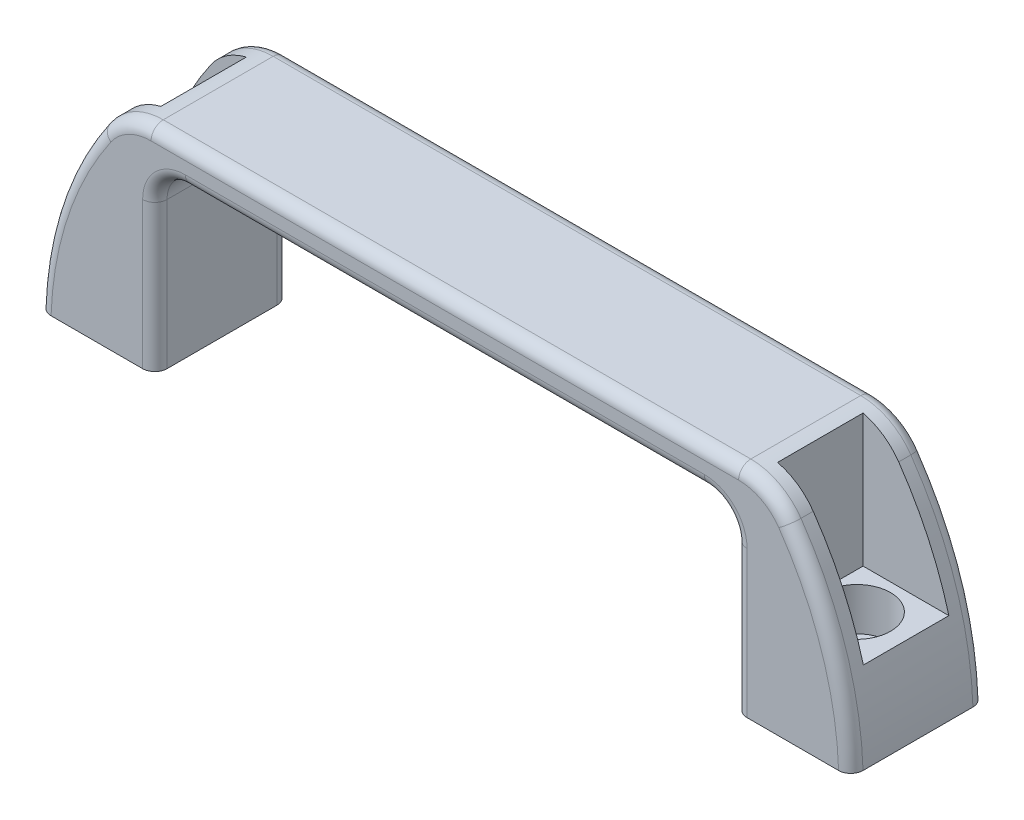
ISO-10303-21;
HEADER;
FILE_DESCRIPTION(('STEP AP214'),'2;1');
FILE_NAME('part.step','',(''),(''),'','','');
FILE_SCHEMA(('AUTOMOTIVE_DESIGN { 1 0 10303 214 1 1 1 1 }'));
ENDSEC;
DATA;
#1=APPLICATION_CONTEXT('core data for automotive mechanical design processes');
#2=APPLICATION_PROTOCOL_DEFINITION('international standard','automotive_design',2000,#1);
#3=PRODUCT_CONTEXT('',#1,'mechanical');
#4=PRODUCT('Part','Part','',(#3));
#5=PRODUCT_RELATED_PRODUCT_CATEGORY('part','',(#4));
#6=PRODUCT_DEFINITION_FORMATION('','',#4);
#7=PRODUCT_DEFINITION_CONTEXT('part definition',#1,'design');
#8=PRODUCT_DEFINITION('design','',#6,#7);
#9=PRODUCT_DEFINITION_SHAPE('','',#8);
#10=(LENGTH_UNIT() NAMED_UNIT(*) SI_UNIT(.MILLI.,.METRE.));
#11=(NAMED_UNIT(*) PLANE_ANGLE_UNIT() SI_UNIT($,.RADIAN.));
#12=(NAMED_UNIT(*) SI_UNIT($,.STERADIAN.) SOLID_ANGLE_UNIT());
#13=UNCERTAINTY_MEASURE_WITH_UNIT(LENGTH_MEASURE(1.E-05),#10,'distance_accuracy_value','');
#14=(GEOMETRIC_REPRESENTATION_CONTEXT(3) GLOBAL_UNCERTAINTY_ASSIGNED_CONTEXT((#13)) GLOBAL_UNIT_ASSIGNED_CONTEXT((#10,
#11,#12)) REPRESENTATION_CONTEXT('',''));
#15=CARTESIAN_POINT('',(0.,0.,0.));
#16=DIRECTION('',(0.,0.,1.));
#17=DIRECTION('',(1.,0.,0.));
#18=AXIS2_PLACEMENT_3D('',#15,#16,#17);
#19=CARTESIAN_POINT('',(426.55276423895,89.7927590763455,11.));
#20=DIRECTION('',(0.,0.,-1.));
#21=DIRECTION('',(-1.,0.,0.));
#22=AXIS2_PLACEMENT_3D('',#19,#20,#21);
#23=CYLINDRICAL_SURFACE('',#22,10.);
#24=DIRECTION('',(0.,0.,-1.));
#25=VECTOR('',#24,1.);
#26=CARTESIAN_POINT('',(426.55276423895,99.7927590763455,11.));
#27=LINE('',#26,#25);
#28=CARTESIAN_POINT('',(426.55276423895,99.7927590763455,9.00000000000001));
#29=VERTEX_POINT('',#28);
#30=CARTESIAN_POINT('',(426.55276423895,99.7927590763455,-8.99999999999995));
#31=VERTEX_POINT('',#30);
#32=EDGE_CURVE('E315',#29,#31,#27,.T.);
#33=ORIENTED_EDGE('',*,*,#32,.T.);
#34=CARTESIAN_POINT('',(426.55276423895,89.7927590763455,-9.00000000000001));
#35=DIRECTION('',(0.,0.,1.));
#36=DIRECTION('',(1.,0.,0.));
#37=AXIS2_PLACEMENT_3D('',#34,#35,#36);
#38=CIRCLE('',#37,10.);
#39=CARTESIAN_POINT('',(418.334661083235,95.4903709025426,-8.99999999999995));
#40=VERTEX_POINT('',#39);
#41=EDGE_CURVE('E595',#31,#40,#38,.T.);
#42=ORIENTED_EDGE('',*,*,#41,.T.);
#43=DIRECTION('',(0.,0.,-1.));
#44=VECTOR('',#43,1.);
#45=CARTESIAN_POINT('',(418.334661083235,95.4903709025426,11.));
#46=LINE('',#45,#44);
#47=CARTESIAN_POINT('',(418.334661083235,95.4903709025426,-7.00000000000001));
#48=VERTEX_POINT('',#47);
#49=EDGE_CURVE('E352',#48,#40,#46,.T.);
#50=ORIENTED_EDGE('',*,*,#49,.F.);
#51=CARTESIAN_POINT('',(426.55276423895,89.7927590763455,-7.00000000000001));
#52=DIRECTION('',(0.,0.,-1.));
#53=DIRECTION('',(-1.,0.,0.));
#54=AXIS2_PLACEMENT_3D('',#51,#52,#53);
#55=CIRCLE('',#54,10.);
#56=CARTESIAN_POINT('',(424.172192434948,99.505270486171,-7.00000000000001));
#57=VERTEX_POINT('',#56);
#58=EDGE_CURVE('E285',#48,#57,#55,.T.);
#59=ORIENTED_EDGE('',*,*,#58,.T.);
#60=DIRECTION('',(0.,0.,-1.));
#61=VECTOR('',#60,1.);
#62=CARTESIAN_POINT('',(424.172192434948,99.505270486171,11.));
#63=LINE('',#62,#61);
#64=CARTESIAN_POINT('',(424.172192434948,99.505270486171,7.00000000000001));
#65=VERTEX_POINT('',#64);
#66=EDGE_CURVE('E274',#57,#65,#63,.F.);
#67=ORIENTED_EDGE('',*,*,#66,.T.);
#68=CARTESIAN_POINT('',(426.55276423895,89.7927590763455,7.00000000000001));
#69=DIRECTION('',(0.,0.,-1.));
#70=DIRECTION('',(-1.,0.,0.));
#71=AXIS2_PLACEMENT_3D('',#68,#69,#70);
#72=CIRCLE('',#71,10.);
#73=CARTESIAN_POINT('',(418.334661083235,95.4903709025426,7.00000000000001));
#74=VERTEX_POINT('',#73);
#75=EDGE_CURVE('E270',#74,#65,#72,.T.);
#76=ORIENTED_EDGE('',*,*,#75,.F.);
#77=CARTESIAN_POINT('',(418.334661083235,95.4903709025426,9.00000000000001));
#78=VERTEX_POINT('',#77);
#79=EDGE_CURVE('E353',#78,#74,#46,.T.);
#80=ORIENTED_EDGE('',*,*,#79,.F.);
#81=CARTESIAN_POINT('',(426.55276423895,89.7927590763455,9.00000000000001));
#82=DIRECTION('',(0.,0.,1.));
#83=DIRECTION('',(1.,0.,0.));
#84=AXIS2_PLACEMENT_3D('',#81,#82,#83);
#85=CIRCLE('',#84,10.);
#86=EDGE_CURVE('E61',#78,#29,#85,.F.);
#87=ORIENTED_EDGE('',*,*,#86,.T.);
#88=EDGE_LOOP('',(#33,#42,#50,#59,#67,#76,#80,#87));
#89=FACE_BOUND('',#88,.T.);
#90=ADVANCED_FACE('F36',(#89),#23,.T.);
#91=CARTESIAN_POINT('',(465.349111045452,62.8952475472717,11.));
#92=DIRECTION('',(0.,0.,-1.));
#93=DIRECTION('',(-1.,0.,0.));
#94=AXIS2_PLACEMENT_3D('',#91,#92,#93);
#95=CYLINDRICAL_SURFACE('',#94,57.208395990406);
#96=ORIENTED_EDGE('',*,*,#49,.T.);
#97=CARTESIAN_POINT('',(465.349111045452,62.8952475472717,-9.00000000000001));
#98=DIRECTION('',(0.,0.,1.));
#99=DIRECTION('',(1.,0.,0.));
#100=AXIS2_PLACEMENT_3D('',#97,#98,#99);
#101=CIRCLE('',#100,57.208395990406);
#102=CARTESIAN_POINT('',(408.172192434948,64.7927590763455,-9.00000000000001));
#103=VERTEX_POINT('',#102);
#104=EDGE_CURVE('E592',#40,#103,#101,.T.);
#105=ORIENTED_EDGE('',*,*,#104,.T.);
#106=DIRECTION('',(0.,0.,-1.));
#107=VECTOR('',#106,1.);
#108=CARTESIAN_POINT('',(408.172192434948,64.7927590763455,11.));
#109=LINE('',#108,#107);
#110=CARTESIAN_POINT('',(408.172192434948,64.7927590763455,9.00000000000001));
#111=VERTEX_POINT('',#110);
#112=EDGE_CURVE('E349',#111,#103,#109,.T.);
#113=ORIENTED_EDGE('',*,*,#112,.F.);
#114=CARTESIAN_POINT('',(465.349111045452,62.8952475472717,9.00000000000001));
#115=DIRECTION('',(0.,0.,1.));
#116=DIRECTION('',(1.,0.,0.));
#117=AXIS2_PLACEMENT_3D('',#114,#115,#116);
#118=CIRCLE('',#117,57.208395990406);
#119=EDGE_CURVE('E590',#111,#78,#118,.F.);
#120=ORIENTED_EDGE('',*,*,#119,.T.);
#121=ORIENTED_EDGE('',*,*,#79,.T.);
#122=CARTESIAN_POINT('',(465.349111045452,62.8952475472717,7.00000000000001));
#123=DIRECTION('',(0.,0.,-1.));
#124=DIRECTION('',(-1.,0.,0.));
#125=AXIS2_PLACEMENT_3D('',#122,#123,#124);
#126=CIRCLE('',#125,57.208395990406);
#127=CARTESIAN_POINT('',(410.114477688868,77.7927590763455,7.00000000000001));
#128=VERTEX_POINT('',#127);
#129=EDGE_CURVE('E368',#128,#74,#126,.T.);
#130=ORIENTED_EDGE('',*,*,#129,.F.);
#131=DIRECTION('',(0.,0.,-1.));
#132=VECTOR('',#131,1.);
#133=CARTESIAN_POINT('',(410.114477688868,77.7927590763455,11.));
#134=LINE('',#133,#132);
#135=CARTESIAN_POINT('',(410.114477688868,77.7927590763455,-7.00000000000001));
#136=VERTEX_POINT('',#135);
#137=EDGE_CURVE('E371',#128,#136,#134,.T.);
#138=ORIENTED_EDGE('',*,*,#137,.T.);
#139=CARTESIAN_POINT('',(465.349111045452,62.8952475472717,-7.00000000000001));
#140=DIRECTION('',(0.,0.,-1.));
#141=DIRECTION('',(-1.,0.,0.));
#142=AXIS2_PLACEMENT_3D('',#139,#140,#141);
#143=CIRCLE('',#142,57.208395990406);
#144=EDGE_CURVE('E256',#136,#48,#143,.T.);
#145=ORIENTED_EDGE('',*,*,#144,.T.);
#146=EDGE_LOOP('',(#96,#105,#113,#120,#121,#130,#138,#145));
#147=FACE_BOUND('',#146,.T.);
#148=ADVANCED_FACE('F420',(#147),#95,.T.);
#149=CARTESIAN_POINT('',(408.172192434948,64.7927590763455,11.));
#150=DIRECTION('',(0.,1.,0.));
#151=DIRECTION('',(0.,0.,1.));
#152=AXIS2_PLACEMENT_3D('',#149,#150,#151);
#153=PLANE('',#152);
#154=CARTESIAN_POINT('',(418.172192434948,64.7927590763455,0.));
#155=DIRECTION('',(0.,1.,0.));
#156=DIRECTION('',(0.,0.,1.));
#157=AXIS2_PLACEMENT_3D('',#154,#155,#156);
#158=CIRCLE('',#157,3.30000000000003);
#159=CARTESIAN_POINT('',(418.172192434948,64.7927590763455,3.30000000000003));
#160=VERTEX_POINT('',#159);
#161=EDGE_CURVE('E282',#160,#160,#158,.T.);
#162=ORIENTED_EDGE('',*,*,#161,.T.);
#163=EDGE_LOOP('',(#162));
#164=FACE_BOUND('',#163,.T.);
#165=DIRECTION('',(0.,0.,-1.));
#166=VECTOR('',#165,1.);
#167=CARTESIAN_POINT('',(427.172192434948,64.7927590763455,11.));
#168=LINE('',#167,#166);
#169=CARTESIAN_POINT('',(427.172192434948,64.7927590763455,9.00000000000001));
#170=VERTEX_POINT('',#169);
#171=CARTESIAN_POINT('',(427.172192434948,64.7927590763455,-9.00000000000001));
#172=VERTEX_POINT('',#171);
#173=EDGE_CURVE('E346',#170,#172,#168,.T.);
#174=ORIENTED_EDGE('',*,*,#173,.F.);
#175=CARTESIAN_POINT('',(425.172192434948,64.7927590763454,9.00000000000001));
#176=DIRECTION('',(0.,1.,0.));
#177=DIRECTION('',(0.,0.,1.));
#178=AXIS2_PLACEMENT_3D('',#175,#176,#177);
#179=CIRCLE('',#178,2.);
#180=CARTESIAN_POINT('',(425.172192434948,64.7927590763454,11.));
#181=VERTEX_POINT('',#180);
#182=EDGE_CURVE('E539',#170,#181,#179,.F.);
#183=ORIENTED_EDGE('',*,*,#182,.T.);
#184=DIRECTION('',(1.,0.,0.));
#185=VECTOR('',#184,1.);
#186=CARTESIAN_POINT('',(408.172192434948,64.7927590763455,11.));
#187=LINE('',#186,#185);
#188=CARTESIAN_POINT('',(410.173333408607,64.7927590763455,11.));
#189=VERTEX_POINT('',#188);
#190=EDGE_CURVE('E306',#189,#181,#187,.T.);
#191=ORIENTED_EDGE('',*,*,#190,.F.);
#192=CARTESIAN_POINT('',(410.173333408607,64.7927590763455,11.));
#193=CARTESIAN_POINT('',(410.11700795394,64.7927590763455,10.9999996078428));
#194=CARTESIAN_POINT('',(410.060709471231,64.7927590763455,10.997621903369));
#195=CARTESIAN_POINT('',(409.948515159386,64.7927590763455,10.9881361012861));
#196=CARTESIAN_POINT('',(409.892619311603,64.7927590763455,10.9810282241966));
#197=CARTESIAN_POINT('',(409.726232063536,64.7927590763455,10.9526762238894));
#198=CARTESIAN_POINT('',(409.616854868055,64.7927590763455,10.9244035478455));
#199=CARTESIAN_POINT('',(409.404402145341,64.7927590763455,10.8498963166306));
#200=CARTESIAN_POINT('',(409.301329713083,64.7927590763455,10.8036530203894));
#201=CARTESIAN_POINT('',(409.104417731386,64.7927590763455,10.6945186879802));
#202=CARTESIAN_POINT('',(409.010576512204,64.7927590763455,10.6316306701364));
#203=CARTESIAN_POINT('',(408.834819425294,64.7927590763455,10.4910077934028));
#204=CARTESIAN_POINT('',(408.75290014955,64.7927590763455,10.4132771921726));
#205=CARTESIAN_POINT('',(408.603265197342,64.7927590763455,10.2451409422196));
#206=CARTESIAN_POINT('',(408.535552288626,64.7927590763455,10.1547328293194));
#207=CARTESIAN_POINT('',(408.416303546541,64.7927590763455,9.96386733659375));
#208=CARTESIAN_POINT('',(408.364762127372,64.7927590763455,9.86341344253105));
#209=CARTESIAN_POINT('',(408.279311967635,64.7927590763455,9.65529542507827));
#210=CARTESIAN_POINT('',(408.245392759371,64.7927590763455,9.54763562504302));
#211=CARTESIAN_POINT('',(408.204619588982,64.7927590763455,9.36609237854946));
#212=CARTESIAN_POINT('',(408.19246674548,64.7927590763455,9.29335493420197));
#213=CARTESIAN_POINT('',(408.176254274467,64.7927590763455,9.14708853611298));
#214=CARTESIAN_POINT('',(408.172183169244,64.7927590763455,9.07356085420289));
#215=CARTESIAN_POINT('',(408.172192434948,64.7927590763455,9.00000000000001));
#216=B_SPLINE_CURVE_WITH_KNOTS('',3,(#192,#193,#194,#195,#196,#197,#198,#199,#200,#201,#202,
#203,#204,#205,#206,#207,#208,#209,#210,#211,#212,#213,#214,#215),.UNSPECIFIED.,.F.,.F.,(4,2,2,
2,2,2,2,2,2,2,2,4),(0.,0.168872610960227,0.337737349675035,0.674915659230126,1.01225818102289,
1.34953957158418,1.68672435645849,2.02397477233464,2.36110856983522,2.69804187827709,
2.91886111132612,3.13936651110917),.UNSPECIFIED.);
#217=EDGE_CURVE('E402',#189,#111,#216,.T.);
#218=ORIENTED_EDGE('',*,*,#217,.T.);
#219=ORIENTED_EDGE('',*,*,#112,.T.);
#220=CARTESIAN_POINT('',(408.172192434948,64.7927590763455,-9.00000000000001));
#221=CARTESIAN_POINT('',(408.172192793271,64.7927590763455,-9.05624676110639));
#222=CARTESIAN_POINT('',(408.174568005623,64.7927590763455,-9.1124665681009));
#223=CARTESIAN_POINT('',(408.184043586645,64.7927590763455,-9.22450371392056));
#224=CARTESIAN_POINT('',(408.191143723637,64.7927590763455,-9.28032107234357));
#225=CARTESIAN_POINT('',(408.219463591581,64.7927590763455,-9.44647042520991));
#226=CARTESIAN_POINT('',(408.247702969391,64.7927590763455,-9.55568921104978));
#227=CARTESIAN_POINT('',(408.322115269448,64.7927590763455,-9.76783204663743));
#228=CARTESIAN_POINT('',(408.36829670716,64.7927590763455,-9.87075308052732));
#229=CARTESIAN_POINT('',(408.477274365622,64.7927590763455,-10.067381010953));
#230=CARTESIAN_POINT('',(408.540067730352,64.7927590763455,-10.1610894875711));
#231=CARTESIAN_POINT('',(408.680501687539,64.7927590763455,-10.3366578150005));
#232=CARTESIAN_POINT('',(408.758145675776,64.7927590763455,-10.4185149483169));
#233=CARTESIAN_POINT('',(408.926086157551,64.7927590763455,-10.568057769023));
#234=CARTESIAN_POINT('',(409.016385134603,64.7927590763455,-10.6357406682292));
#235=CARTESIAN_POINT('',(409.207115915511,64.7927590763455,-10.7550397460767));
#236=CARTESIAN_POINT('',(409.307554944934,64.7927590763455,-10.8066443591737));
#237=CARTESIAN_POINT('',(409.515648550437,64.7927590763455,-10.8922424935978));
#238=CARTESIAN_POINT('',(409.623298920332,64.7927590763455,-10.9262461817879));
#239=CARTESIAN_POINT('',(409.805223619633,64.7927590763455,-10.9672685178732));
#240=CARTESIAN_POINT('',(409.878357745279,64.7927590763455,-10.9795354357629));
#241=CARTESIAN_POINT('',(410.02542888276,64.7927590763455,-10.9959001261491));
#242=CARTESIAN_POINT('',(410.099364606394,64.7927590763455,-11.0000094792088));
#243=CARTESIAN_POINT('',(410.173333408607,64.7927590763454,-11.));
#244=B_SPLINE_CURVE_WITH_KNOTS('',3,(#220,#221,#222,#223,#224,#225,#226,#227,#228,#229,#230,
#231,#232,#233,#234,#235,#236,#237,#238,#239,#240,#241,#242,#243),.UNSPECIFIED.,.F.,.F.,(4,2,2,
2,2,2,2,2,2,2,2,4),(0.,0.168636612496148,0.337264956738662,0.673960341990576,1.01081572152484,
1.34761322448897,1.68448783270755,2.02142864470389,2.35861127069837,2.69559891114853,
2.91764229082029,3.1393702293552),.UNSPECIFIED.);
#245=CARTESIAN_POINT('',(410.173333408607,64.7927590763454,-11.));
#246=VERTEX_POINT('',#245);
#247=EDGE_CURVE('E408',#103,#246,#244,.T.);
#248=ORIENTED_EDGE('',*,*,#247,.T.);
#249=DIRECTION('',(1.,0.,0.));
#250=VECTOR('',#249,1.);
#251=CARTESIAN_POINT('',(408.172192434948,64.7927590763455,-11.));
#252=LINE('',#251,#250);
#253=CARTESIAN_POINT('',(425.172192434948,64.7927590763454,-11.));
#254=VERTEX_POINT('',#253);
#255=EDGE_CURVE('E305',#246,#254,#252,.T.);
#256=ORIENTED_EDGE('',*,*,#255,.T.);
#257=CARTESIAN_POINT('',(425.172192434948,64.7927590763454,-9.00000000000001));
#258=DIRECTION('',(0.,1.,0.));
#259=DIRECTION('',(0.,0.,1.));
#260=AXIS2_PLACEMENT_3D('',#257,#258,#259);
#261=CIRCLE('',#260,2.);
#262=EDGE_CURVE('E542',#254,#172,#261,.F.);
#263=ORIENTED_EDGE('',*,*,#262,.T.);
#264=EDGE_LOOP('',(#174,#183,#191,#218,#219,#248,#256,#263));
#265=FACE_BOUND('',#264,.T.);
#266=ADVANCED_FACE('F414',(#164,#265),#153,.F.);
#267=CARTESIAN_POINT('',(427.172192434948,88.7927590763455,11.));
#268=DIRECTION('',(-1.,0.,0.));
#269=DIRECTION('',(0.,-1.,0.));
#270=AXIS2_PLACEMENT_3D('',#267,#268,#269);
#271=PLANE('',#270);
#272=DIRECTION('',(0.,0.,-1.));
#273=VECTOR('',#272,1.);
#274=CARTESIAN_POINT('',(427.172192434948,88.7927590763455,11.));
#275=LINE('',#274,#273);
#276=CARTESIAN_POINT('',(427.172192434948,88.7927590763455,9.00000000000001));
#277=VERTEX_POINT('',#276);
#278=CARTESIAN_POINT('',(427.172192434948,88.7927590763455,-9.00000000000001));
#279=VERTEX_POINT('',#278);
#280=EDGE_CURVE('E343',#277,#279,#275,.T.);
#281=ORIENTED_EDGE('',*,*,#280,.F.);
#282=DIRECTION('',(0.,1.,0.));
#283=VECTOR('',#282,1.);
#284=CARTESIAN_POINT('',(427.172192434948,64.7927590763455,9.00000000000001));
#285=LINE('',#284,#283);
#286=EDGE_CURVE('E400',#277,#170,#285,.F.);
#287=ORIENTED_EDGE('',*,*,#286,.T.);
#288=ORIENTED_EDGE('',*,*,#173,.T.);
#289=DIRECTION('',(0.,1.,0.));
#290=VECTOR('',#289,1.);
#291=CARTESIAN_POINT('',(427.172192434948,88.7927590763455,-9.00000000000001));
#292=LINE('',#291,#290);
#293=EDGE_CURVE('E397',#172,#279,#292,.T.);
#294=ORIENTED_EDGE('',*,*,#293,.T.);
#295=EDGE_LOOP('',(#281,#287,#288,#294));
#296=FACE_BOUND('',#295,.T.);
#297=ADVANCED_FACE('F419',(#296),#271,.F.);
#298=CARTESIAN_POINT('',(432.172192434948,88.7927590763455,11.));
#299=DIRECTION('',(0.,0.,-1.));
#300=DIRECTION('',(-1.,0.,0.));
#301=AXIS2_PLACEMENT_3D('',#298,#299,#300);
#302=CYLINDRICAL_SURFACE('',#301,4.99999999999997);
#303=DIRECTION('',(0.,0.,-1.));
#304=VECTOR('',#303,1.);
#305=CARTESIAN_POINT('',(432.172192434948,93.7927590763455,11.));
#306=LINE('',#305,#304);
#307=CARTESIAN_POINT('',(432.172192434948,93.7927590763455,9.00000000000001));
#308=VERTEX_POINT('',#307);
#309=CARTESIAN_POINT('',(432.172192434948,93.7927590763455,-8.99999999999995));
#310=VERTEX_POINT('',#309);
#311=EDGE_CURVE('E340',#308,#310,#306,.T.);
#312=ORIENTED_EDGE('',*,*,#311,.F.);
#313=CARTESIAN_POINT('',(432.172192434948,88.7927590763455,9.00000000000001));
#314=DIRECTION('',(0.,0.,1.));
#315=DIRECTION('',(1.,0.,0.));
#316=AXIS2_PLACEMENT_3D('',#313,#314,#315);
#317=CIRCLE('',#316,4.99999999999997);
#318=EDGE_CURVE('E524',#308,#277,#317,.T.);
#319=ORIENTED_EDGE('',*,*,#318,.T.);
#320=ORIENTED_EDGE('',*,*,#280,.T.);
#321=CARTESIAN_POINT('',(432.172192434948,88.7927590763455,-9.00000000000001));
#322=DIRECTION('',(0.,0.,1.));
#323=DIRECTION('',(1.,0.,0.));
#324=AXIS2_PLACEMENT_3D('',#321,#322,#323);
#325=CIRCLE('',#324,4.99999999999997);
#326=EDGE_CURVE('E527',#279,#310,#325,.F.);
#327=ORIENTED_EDGE('',*,*,#326,.T.);
#328=EDGE_LOOP('',(#312,#319,#320,#327));
#329=FACE_BOUND('',#328,.T.);
#330=ADVANCED_FACE('F513',(#329),#302,.F.);
#331=CARTESIAN_POINT('',(432.172192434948,93.7927590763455,11.));
#332=DIRECTION('',(0.,1.,0.));
#333=DIRECTION('',(0.,0.,1.));
#334=AXIS2_PLACEMENT_3D('',#331,#332,#333);
#335=PLANE('',#334);
#336=DIRECTION('',(0.,0.,-1.));
#337=VECTOR('',#336,1.);
#338=CARTESIAN_POINT('',(517.172192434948,93.7927590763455,11.));
#339=LINE('',#338,#337);
#340=CARTESIAN_POINT('',(517.172192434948,93.7927590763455,9.00000000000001));
#341=VERTEX_POINT('',#340);
#342=CARTESIAN_POINT('',(517.172192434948,93.7927590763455,-9.00000000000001));
#343=VERTEX_POINT('',#342);
#344=EDGE_CURVE('E337',#341,#343,#339,.T.);
#345=ORIENTED_EDGE('',*,*,#344,.F.);
#346=DIRECTION('',(1.,0.,0.));
#347=VECTOR('',#346,1.);
#348=CARTESIAN_POINT('',(432.172192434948,93.7927590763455,9.00000000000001));
#349=LINE('',#348,#347);
#350=EDGE_CURVE('E11',#341,#308,#349,.F.);
#351=ORIENTED_EDGE('',*,*,#350,.T.);
#352=ORIENTED_EDGE('',*,*,#311,.T.);
#353=DIRECTION('',(1.,0.,0.));
#354=VECTOR('',#353,1.);
#355=CARTESIAN_POINT('',(432.172192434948,93.7927590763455,-8.99999999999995));
#356=LINE('',#355,#354);
#357=EDGE_CURVE('E46',#310,#343,#356,.T.);
#358=ORIENTED_EDGE('',*,*,#357,.T.);
#359=EDGE_LOOP('',(#345,#351,#352,#358));
#360=FACE_BOUND('',#359,.T.);
#361=ADVANCED_FACE('F510',(#360),#335,.F.);
#362=CARTESIAN_POINT('',(517.172192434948,88.7927590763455,11.));
#363=DIRECTION('',(0.,0.,-1.));
#364=DIRECTION('',(-1.,0.,0.));
#365=AXIS2_PLACEMENT_3D('',#362,#363,#364);
#366=CYLINDRICAL_SURFACE('',#365,5.);
#367=DIRECTION('',(0.,0.,-1.));
#368=VECTOR('',#367,1.);
#369=CARTESIAN_POINT('',(522.172192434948,88.7927590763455,11.));
#370=LINE('',#369,#368);
#371=CARTESIAN_POINT('',(522.172192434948,88.7927590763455,9.00000000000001));
#372=VERTEX_POINT('',#371);
#373=CARTESIAN_POINT('',(522.172192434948,88.7927590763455,-9.00000000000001));
#374=VERTEX_POINT('',#373);
#375=EDGE_CURVE('E333',#372,#374,#370,.T.);
#376=ORIENTED_EDGE('',*,*,#375,.F.);
#377=CARTESIAN_POINT('',(517.172192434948,88.7927590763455,9.00000000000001));
#378=DIRECTION('',(0.,0.,1.));
#379=DIRECTION('',(1.,0.,0.));
#380=AXIS2_PLACEMENT_3D('',#377,#378,#379);
#381=CIRCLE('',#380,5.);
#382=EDGE_CURVE('E658',#372,#341,#381,.T.);
#383=ORIENTED_EDGE('',*,*,#382,.T.);
#384=ORIENTED_EDGE('',*,*,#344,.T.);
#385=CARTESIAN_POINT('',(517.172192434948,88.7927590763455,-9.00000000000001));
#386=DIRECTION('',(0.,0.,1.));
#387=DIRECTION('',(1.,0.,0.));
#388=AXIS2_PLACEMENT_3D('',#385,#386,#387);
#389=CIRCLE('',#388,5.);
#390=EDGE_CURVE('E828',#343,#374,#389,.F.);
#391=ORIENTED_EDGE('',*,*,#390,.T.);
#392=EDGE_LOOP('',(#376,#383,#384,#391));
#393=FACE_BOUND('',#392,.T.);
#394=ADVANCED_FACE('F506',(#393),#366,.F.);
#395=CARTESIAN_POINT('',(522.172192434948,88.7927590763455,11.));
#396=DIRECTION('',(1.,0.,0.));
#397=DIRECTION('',(0.,0.,-1.));
#398=AXIS2_PLACEMENT_3D('',#395,#396,#397);
#399=PLANE('',#398);
#400=DIRECTION('',(0.,0.,-1.));
#401=VECTOR('',#400,1.);
#402=CARTESIAN_POINT('',(522.172192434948,64.7927590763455,11.));
#403=LINE('',#402,#401);
#404=CARTESIAN_POINT('',(522.172192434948,64.7927590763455,9.00000000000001));
#405=VERTEX_POINT('',#404);
#406=CARTESIAN_POINT('',(522.172192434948,64.7927590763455,-9.00000000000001));
#407=VERTEX_POINT('',#406);
#408=EDGE_CURVE('E329',#405,#407,#403,.T.);
#409=ORIENTED_EDGE('',*,*,#408,.F.);
#410=DIRECTION('',(0.,-1.,0.));
#411=VECTOR('',#410,1.);
#412=CARTESIAN_POINT('',(522.172192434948,88.7927590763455,9.00000000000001));
#413=LINE('',#412,#411);
#414=EDGE_CURVE('E661',#405,#372,#413,.F.);
#415=ORIENTED_EDGE('',*,*,#414,.T.);
#416=ORIENTED_EDGE('',*,*,#375,.T.);
#417=DIRECTION('',(0.,-1.,0.));
#418=VECTOR('',#417,1.);
#419=CARTESIAN_POINT('',(522.172192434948,88.7927590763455,-9.00000000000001));
#420=LINE('',#419,#418);
#421=EDGE_CURVE('E823',#374,#407,#420,.T.);
#422=ORIENTED_EDGE('',*,*,#421,.T.);
#423=EDGE_LOOP('',(#409,#415,#416,#422));
#424=FACE_BOUND('',#423,.T.);
#425=ADVANCED_FACE('F500',(#424),#399,.F.);
#426=CARTESIAN_POINT('',(522.172192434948,64.7927590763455,11.));
#427=DIRECTION('',(0.,1.,0.));
#428=DIRECTION('',(-1.,0.,0.));
#429=AXIS2_PLACEMENT_3D('',#426,#427,#428);
#430=PLANE('',#429);
#431=CARTESIAN_POINT('',(531.172192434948,64.7927590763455,0.));
#432=DIRECTION('',(0.,1.,0.));
#433=DIRECTION('',(0.,0.,1.));
#434=AXIS2_PLACEMENT_3D('',#431,#432,#433);
#435=CIRCLE('',#434,3.29999999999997);
#436=CARTESIAN_POINT('',(531.172192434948,64.7927590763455,3.29999999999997));
#437=VERTEX_POINT('',#436);
#438=EDGE_CURVE('E814',#437,#437,#435,.T.);
#439=ORIENTED_EDGE('',*,*,#438,.T.);
#440=EDGE_LOOP('',(#439));
#441=FACE_BOUND('',#440,.T.);
#442=DIRECTION('',(1.,0.,0.));
#443=VECTOR('',#442,1.);
#444=CARTESIAN_POINT('',(522.172192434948,64.7927590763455,11.));
#445=LINE('',#444,#443);
#446=CARTESIAN_POINT('',(524.172192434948,64.7927590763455,11.));
#447=VERTEX_POINT('',#446);
#448=CARTESIAN_POINT('',(539.171051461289,64.7927590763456,11.));
#449=VERTEX_POINT('',#448);
#450=EDGE_CURVE('E310',#447,#449,#445,.T.);
#451=ORIENTED_EDGE('',*,*,#450,.F.);
#452=CARTESIAN_POINT('',(524.172192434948,64.7927590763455,9.00000000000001));
#453=DIRECTION('',(0.,1.,0.));
#454=DIRECTION('',(-1.,0.,0.));
#455=AXIS2_PLACEMENT_3D('',#452,#453,#454);
#456=CIRCLE('',#455,2.);
#457=EDGE_CURVE('E662',#447,#405,#456,.F.);
#458=ORIENTED_EDGE('',*,*,#457,.T.);
#459=ORIENTED_EDGE('',*,*,#408,.T.);
#460=CARTESIAN_POINT('',(524.172192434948,64.7927590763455,-9.00000000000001));
#461=DIRECTION('',(0.,1.,0.));
#462=DIRECTION('',(-1.,0.,0.));
#463=AXIS2_PLACEMENT_3D('',#460,#461,#462);
#464=CIRCLE('',#463,2.);
#465=CARTESIAN_POINT('',(524.172192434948,64.7927590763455,-11.));
#466=VERTEX_POINT('',#465);
#467=EDGE_CURVE('E486',#407,#466,#464,.F.);
#468=ORIENTED_EDGE('',*,*,#467,.T.);
#469=DIRECTION('',(1.,0.,0.));
#470=VECTOR('',#469,1.);
#471=CARTESIAN_POINT('',(522.172192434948,64.7927590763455,-11.));
#472=LINE('',#471,#470);
#473=CARTESIAN_POINT('',(539.171051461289,64.7927590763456,-11.));
#474=VERTEX_POINT('',#473);
#475=EDGE_CURVE('E311',#466,#474,#472,.T.);
#476=ORIENTED_EDGE('',*,*,#475,.T.);
#477=CARTESIAN_POINT('',(539.171051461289,64.7927590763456,-11.));
#478=CARTESIAN_POINT('',(539.227376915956,64.7927590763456,-10.9999996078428));
#479=CARTESIAN_POINT('',(539.283675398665,64.7927590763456,-10.9976219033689));
#480=CARTESIAN_POINT('',(539.39586971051,64.7927590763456,-10.9881361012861));
#481=CARTESIAN_POINT('',(539.451765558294,64.7927590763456,-10.9810282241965));
#482=CARTESIAN_POINT('',(539.618152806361,64.7927590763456,-10.9526762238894));
#483=CARTESIAN_POINT('',(539.727530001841,64.7927590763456,-10.9244035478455));
#484=CARTESIAN_POINT('',(539.939982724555,64.7927590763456,-10.8498963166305));
#485=CARTESIAN_POINT('',(540.043055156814,64.7927590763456,-10.8036530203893));
#486=CARTESIAN_POINT('',(540.239967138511,64.7927590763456,-10.6945186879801));
#487=CARTESIAN_POINT('',(540.333808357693,64.7927590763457,-10.6316306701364));
#488=CARTESIAN_POINT('',(540.509565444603,64.7927590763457,-10.4910077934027));
#489=CARTESIAN_POINT('',(540.591484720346,64.7927590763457,-10.4132771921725));
#490=CARTESIAN_POINT('',(540.741119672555,64.7927590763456,-10.2451409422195));
#491=CARTESIAN_POINT('',(540.808832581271,64.7927590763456,-10.1547328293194));
#492=CARTESIAN_POINT('',(540.928081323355,64.7927590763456,-9.96386733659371));
#493=CARTESIAN_POINT('',(540.979622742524,64.7927590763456,-9.86341344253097));
#494=CARTESIAN_POINT('',(541.065072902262,64.7927590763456,-9.65529542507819));
#495=CARTESIAN_POINT('',(541.098992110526,64.7927590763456,-9.54763562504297));
#496=CARTESIAN_POINT('',(541.139765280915,64.7927590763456,-9.36609237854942));
#497=CARTESIAN_POINT('',(541.151918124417,64.7927590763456,-9.29335493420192));
#498=CARTESIAN_POINT('',(541.168130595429,64.7927590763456,-9.14708853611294));
#499=CARTESIAN_POINT('',(541.172201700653,64.7927590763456,-9.07356085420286));
#500=CARTESIAN_POINT('',(541.172192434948,64.7927590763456,-9.00000000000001));
#501=B_SPLINE_CURVE_WITH_KNOTS('',3,(#477,#478,#479,#480,#481,#482,#483,#484,#485,#486,#487,
#488,#489,#490,#491,#492,#493,#494,#495,#496,#497,#498,#499,#500),.UNSPECIFIED.,.F.,.F.,(4,2,2,
2,2,2,2,2,2,2,2,4),(0.,0.168872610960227,0.337737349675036,0.674915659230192,1.01225818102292,
1.34953957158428,1.68672435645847,2.02397477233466,2.3611085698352,2.69804187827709,
2.91886111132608,3.1393665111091),.UNSPECIFIED.);
#502=CARTESIAN_POINT('',(541.172192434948,64.7927590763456,-9.00000000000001));
#503=VERTEX_POINT('',#502);
#504=EDGE_CURVE('E479',#474,#503,#501,.T.);
#505=ORIENTED_EDGE('',*,*,#504,.T.);
#506=DIRECTION('',(0.,0.,-1.));
#507=VECTOR('',#506,1.);
#508=CARTESIAN_POINT('',(541.172192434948,64.7927590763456,11.));
#509=LINE('',#508,#507);
#510=CARTESIAN_POINT('',(541.172192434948,64.7927590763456,9.00000000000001));
#511=VERTEX_POINT('',#510);
#512=EDGE_CURVE('E326',#511,#503,#509,.T.);
#513=ORIENTED_EDGE('',*,*,#512,.F.);
#514=CARTESIAN_POINT('',(541.172192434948,64.7927590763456,9.00000000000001));
#515=CARTESIAN_POINT('',(541.172192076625,64.7927590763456,9.05624676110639));
#516=CARTESIAN_POINT('',(541.169816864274,64.7927590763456,9.1124665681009));
#517=CARTESIAN_POINT('',(541.160341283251,64.7927590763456,9.22450371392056));
#518=CARTESIAN_POINT('',(541.15324114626,64.7927590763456,9.28032107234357));
#519=CARTESIAN_POINT('',(541.124921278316,64.7927590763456,9.44647042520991));
#520=CARTESIAN_POINT('',(541.096681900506,64.7927590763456,9.55568921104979));
#521=CARTESIAN_POINT('',(541.022269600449,64.7927590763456,9.76783204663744));
#522=CARTESIAN_POINT('',(540.976088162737,64.7927590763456,9.87075308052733));
#523=CARTESIAN_POINT('',(540.867110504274,64.7927590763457,10.067381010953));
#524=CARTESIAN_POINT('',(540.804317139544,64.7927590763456,10.1610894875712));
#525=CARTESIAN_POINT('',(540.663883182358,64.7927590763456,10.3366578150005));
#526=CARTESIAN_POINT('',(540.58623919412,64.7927590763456,10.4185149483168));
#527=CARTESIAN_POINT('',(540.418298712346,64.7927590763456,10.568057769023));
#528=CARTESIAN_POINT('',(540.327999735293,64.7927590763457,10.6357406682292));
#529=CARTESIAN_POINT('',(540.137268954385,64.7927590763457,10.7550397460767));
#530=CARTESIAN_POINT('',(540.036829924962,64.7927590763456,10.8066443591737));
#531=CARTESIAN_POINT('',(539.828736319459,64.7927590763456,10.8922424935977));
#532=CARTESIAN_POINT('',(539.721085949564,64.7927590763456,10.9262461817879));
#533=CARTESIAN_POINT('',(539.539161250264,64.7927590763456,10.9672685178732));
#534=CARTESIAN_POINT('',(539.466027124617,64.7927590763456,10.9795354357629));
#535=CARTESIAN_POINT('',(539.318955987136,64.7927590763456,10.9959001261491));
#536=CARTESIAN_POINT('',(539.245020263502,64.7927590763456,11.0000094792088));
#537=CARTESIAN_POINT('',(539.171051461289,64.7927590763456,11.));
#538=B_SPLINE_CURVE_WITH_KNOTS('',3,(#514,#515,#516,#517,#518,#519,#520,#521,#522,#523,#524,
#525,#526,#527,#528,#529,#530,#531,#532,#533,#534,#535,#536,#537),.UNSPECIFIED.,.F.,.F.,(4,2,2,
2,2,2,2,2,2,2,2,4),(0.,0.168636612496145,0.33726495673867,0.673960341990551,1.01081572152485,
1.34761322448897,1.68448783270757,2.02142864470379,2.35861127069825,2.69559891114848,
2.91764229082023,3.13937022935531),.UNSPECIFIED.);
#539=EDGE_CURVE('E487',#511,#449,#538,.T.);
#540=ORIENTED_EDGE('',*,*,#539,.T.);
#541=EDGE_LOOP('',(#451,#458,#459,#468,#476,#505,#513,#540));
#542=FACE_BOUND('',#541,.T.);
#543=ADVANCED_FACE('F494',(#441,#542),#430,.F.);
#544=CARTESIAN_POINT('',(483.995273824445,62.8952475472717,11.));
#545=DIRECTION('',(0.,0.,-1.));
#546=DIRECTION('',(-1.,0.,0.));
#547=AXIS2_PLACEMENT_3D('',#544,#545,#546);
#548=CYLINDRICAL_SURFACE('',#547,57.2083959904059);
#549=ORIENTED_EDGE('',*,*,#512,.T.);
#550=CARTESIAN_POINT('',(483.995273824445,62.8952475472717,-9.00000000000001));
#551=DIRECTION('',(0.,0.,1.));
#552=DIRECTION('',(1.,0.,0.));
#553=AXIS2_PLACEMENT_3D('',#550,#551,#552);
#554=CIRCLE('',#553,57.2083959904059);
#555=CARTESIAN_POINT('',(531.009723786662,95.4903709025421,-9.00000000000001));
#556=VERTEX_POINT('',#555);
#557=EDGE_CURVE('E583',#503,#556,#554,.T.);
#558=ORIENTED_EDGE('',*,*,#557,.T.);
#559=DIRECTION('',(0.,0.,-1.));
#560=VECTOR('',#559,1.);
#561=CARTESIAN_POINT('',(531.009723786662,95.4903709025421,11.));
#562=LINE('',#561,#560);
#563=CARTESIAN_POINT('',(531.009723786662,95.4903709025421,-7.00000000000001));
#564=VERTEX_POINT('',#563);
#565=EDGE_CURVE('E323',#564,#556,#562,.T.);
#566=ORIENTED_EDGE('',*,*,#565,.F.);
#567=CARTESIAN_POINT('',(483.995273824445,62.8952475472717,-7.00000000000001));
#568=DIRECTION('',(0.,0.,-1.));
#569=DIRECTION('',(-1.,0.,0.));
#570=AXIS2_PLACEMENT_3D('',#567,#568,#569);
#571=CIRCLE('',#570,57.2083959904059);
#572=CARTESIAN_POINT('',(539.229907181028,77.7927590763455,-7.00000000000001));
#573=VERTEX_POINT('',#572);
#574=EDGE_CURVE('E302',#564,#573,#571,.T.);
#575=ORIENTED_EDGE('',*,*,#574,.T.);
#576=DIRECTION('',(0.,0.,-1.));
#577=VECTOR('',#576,1.);
#578=CARTESIAN_POINT('',(539.229907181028,77.7927590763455,11.));
#579=LINE('',#578,#577);
#580=CARTESIAN_POINT('',(539.229907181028,77.7927590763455,7.00000000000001));
#581=VERTEX_POINT('',#580);
#582=EDGE_CURVE('E365',#573,#581,#579,.F.);
#583=ORIENTED_EDGE('',*,*,#582,.T.);
#584=CARTESIAN_POINT('',(483.995273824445,62.8952475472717,7.00000000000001));
#585=DIRECTION('',(0.,0.,-1.));
#586=DIRECTION('',(-1.,0.,0.));
#587=AXIS2_PLACEMENT_3D('',#584,#585,#586);
#588=CIRCLE('',#587,57.2083959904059);
#589=CARTESIAN_POINT('',(531.009723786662,95.4903709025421,7.00000000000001));
#590=VERTEX_POINT('',#589);
#591=EDGE_CURVE('E300',#590,#581,#588,.T.);
#592=ORIENTED_EDGE('',*,*,#591,.F.);
#593=CARTESIAN_POINT('',(531.009723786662,95.4903709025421,9.00000000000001));
#594=VERTEX_POINT('',#593);
#595=EDGE_CURVE('E324',#594,#590,#562,.T.);
#596=ORIENTED_EDGE('',*,*,#595,.F.);
#597=CARTESIAN_POINT('',(483.995273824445,62.8952475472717,9.00000000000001));
#598=DIRECTION('',(0.,0.,1.));
#599=DIRECTION('',(1.,0.,0.));
#600=AXIS2_PLACEMENT_3D('',#597,#598,#599);
#601=CIRCLE('',#600,57.2083959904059);
#602=EDGE_CURVE('E581',#594,#511,#601,.F.);
#603=ORIENTED_EDGE('',*,*,#602,.T.);
#604=EDGE_LOOP('',(#549,#558,#566,#575,#583,#592,#596,#603));
#605=FACE_BOUND('',#604,.T.);
#606=ADVANCED_FACE('F499',(#605),#548,.T.);
#607=CARTESIAN_POINT('',(522.791620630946,89.7927590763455,11.));
#608=DIRECTION('',(0.,0.,-1.));
#609=DIRECTION('',(-1.,0.,0.));
#610=AXIS2_PLACEMENT_3D('',#607,#608,#609);
#611=CYLINDRICAL_SURFACE('',#610,10.);
#612=ORIENTED_EDGE('',*,*,#565,.T.);
#613=CARTESIAN_POINT('',(522.791620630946,89.7927590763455,-9.00000000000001));
#614=DIRECTION('',(0.,0.,1.));
#615=DIRECTION('',(1.,0.,0.));
#616=AXIS2_PLACEMENT_3D('',#613,#614,#615);
#617=CIRCLE('',#616,10.);
#618=CARTESIAN_POINT('',(522.791620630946,99.7927590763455,-9.00000000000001));
#619=VERTEX_POINT('',#618);
#620=EDGE_CURVE('E588',#556,#619,#617,.T.);
#621=ORIENTED_EDGE('',*,*,#620,.T.);
#622=DIRECTION('',(0.,0.,-1.));
#623=VECTOR('',#622,1.);
#624=CARTESIAN_POINT('',(522.791620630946,99.7927590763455,11.));
#625=LINE('',#624,#623);
#626=CARTESIAN_POINT('',(522.791620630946,99.7927590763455,9.00000000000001));
#627=VERTEX_POINT('',#626);
#628=EDGE_CURVE('E321',#627,#619,#625,.T.);
#629=ORIENTED_EDGE('',*,*,#628,.F.);
#630=CARTESIAN_POINT('',(522.791620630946,89.7927590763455,9.00000000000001));
#631=DIRECTION('',(0.,0.,1.));
#632=DIRECTION('',(1.,0.,0.));
#633=AXIS2_PLACEMENT_3D('',#630,#631,#632);
#634=CIRCLE('',#633,10.);
#635=EDGE_CURVE('E586',#627,#594,#634,.F.);
#636=ORIENTED_EDGE('',*,*,#635,.T.);
#637=ORIENTED_EDGE('',*,*,#595,.T.);
#638=CARTESIAN_POINT('',(522.791620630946,89.7927590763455,7.00000000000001));
#639=DIRECTION('',(0.,0.,-1.));
#640=DIRECTION('',(-1.,0.,0.));
#641=AXIS2_PLACEMENT_3D('',#638,#639,#640);
#642=CIRCLE('',#641,10.);
#643=CARTESIAN_POINT('',(525.172192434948,99.5052704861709,7.00000000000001));
#644=VERTEX_POINT('',#643);
#645=EDGE_CURVE('E355',#644,#590,#642,.T.);
#646=ORIENTED_EDGE('',*,*,#645,.F.);
#647=DIRECTION('',(0.,0.,-1.));
#648=VECTOR('',#647,1.);
#649=CARTESIAN_POINT('',(525.172192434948,99.5052704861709,11.));
#650=LINE('',#649,#648);
#651=CARTESIAN_POINT('',(525.172192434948,99.5052704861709,-7.00000000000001));
#652=VERTEX_POINT('',#651);
#653=EDGE_CURVE('E358',#644,#652,#650,.T.);
#654=ORIENTED_EDGE('',*,*,#653,.T.);
#655=CARTESIAN_POINT('',(522.791620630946,89.7927590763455,-7.00000000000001));
#656=DIRECTION('',(0.,0.,-1.));
#657=DIRECTION('',(-1.,0.,0.));
#658=AXIS2_PLACEMENT_3D('',#655,#656,#657);
#659=CIRCLE('',#658,10.);
#660=EDGE_CURVE('E362',#652,#564,#659,.T.);
#661=ORIENTED_EDGE('',*,*,#660,.T.);
#662=EDGE_LOOP('',(#612,#621,#629,#636,#637,#646,#654,#661));
#663=FACE_BOUND('',#662,.T.);
#664=ADVANCED_FACE('F683',(#663),#611,.T.);
#665=CARTESIAN_POINT('',(426.55276423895,99.7927590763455,11.));
#666=DIRECTION('',(0.,-1.,0.));
#667=DIRECTION('',(0.,0.,-1.));
#668=AXIS2_PLACEMENT_3D('',#665,#666,#667);
#669=PLANE('',#668);
#670=ORIENTED_EDGE('',*,*,#32,.F.);
#671=DIRECTION('',(-1.,0.,0.));
#672=VECTOR('',#671,1.);
#673=CARTESIAN_POINT('',(522.791620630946,99.7927590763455,9.00000000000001));
#674=LINE('',#673,#672);
#675=EDGE_CURVE('E598',#29,#627,#674,.F.);
#676=ORIENTED_EDGE('',*,*,#675,.T.);
#677=ORIENTED_EDGE('',*,*,#628,.T.);
#678=DIRECTION('',(-1.,0.,0.));
#679=VECTOR('',#678,1.);
#680=CARTESIAN_POINT('',(426.55276423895,99.7927590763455,-8.99999999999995));
#681=LINE('',#680,#679);
#682=EDGE_CURVE('E54',#619,#31,#681,.T.);
#683=ORIENTED_EDGE('',*,*,#682,.T.);
#684=EDGE_LOOP('',(#670,#676,#677,#683));
#685=FACE_BOUND('',#684,.T.);
#686=ADVANCED_FACE('F708',(#685),#669,.F.);
#687=CARTESIAN_POINT('',(426.55276423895,89.7927590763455,11.));
#688=DIRECTION('',(0.,0.,1.));
#689=DIRECTION('',(1.,0.,0.));
#690=AXIS2_PLACEMENT_3D('',#687,#688,#689);
#691=PLANE('',#690);
#692=ORIENTED_EDGE('',*,*,#190,.T.);
#693=DIRECTION('',(0.,1.,0.));
#694=VECTOR('',#693,1.);
#695=CARTESIAN_POINT('',(425.172192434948,88.7927590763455,11.));
#696=LINE('',#695,#694);
#697=CARTESIAN_POINT('',(425.172192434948,88.7927590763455,11.));
#698=VERTEX_POINT('',#697);
#699=EDGE_CURVE('E394',#181,#698,#696,.T.);
#700=ORIENTED_EDGE('',*,*,#699,.T.);
#701=CARTESIAN_POINT('',(432.172192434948,88.7927590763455,11.));
#702=DIRECTION('',(0.,0.,1.));
#703=DIRECTION('',(1.,0.,0.));
#704=AXIS2_PLACEMENT_3D('',#701,#702,#703);
#705=CIRCLE('',#704,6.99999999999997);
#706=CARTESIAN_POINT('',(432.172192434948,95.7927590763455,11.));
#707=VERTEX_POINT('',#706);
#708=EDGE_CURVE('E392',#698,#707,#705,.F.);
#709=ORIENTED_EDGE('',*,*,#708,.T.);
#710=DIRECTION('',(1.,0.,0.));
#711=VECTOR('',#710,1.);
#712=CARTESIAN_POINT('',(517.172192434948,95.7927590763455,11.));
#713=LINE('',#712,#711);
#714=CARTESIAN_POINT('',(517.172192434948,95.7927590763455,11.));
#715=VERTEX_POINT('',#714);
#716=EDGE_CURVE('E386',#707,#715,#713,.T.);
#717=ORIENTED_EDGE('',*,*,#716,.T.);
#718=CARTESIAN_POINT('',(517.172192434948,88.7927590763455,11.));
#719=DIRECTION('',(0.,0.,1.));
#720=DIRECTION('',(1.,0.,0.));
#721=AXIS2_PLACEMENT_3D('',#718,#719,#720);
#722=CIRCLE('',#721,7.);
#723=CARTESIAN_POINT('',(524.172192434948,88.7927590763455,11.));
#724=VERTEX_POINT('',#723);
#725=EDGE_CURVE('E388',#715,#724,#722,.F.);
#726=ORIENTED_EDGE('',*,*,#725,.T.);
#727=DIRECTION('',(0.,-1.,0.));
#728=VECTOR('',#727,1.);
#729=CARTESIAN_POINT('',(524.172192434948,64.7927590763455,11.));
#730=LINE('',#729,#728);
#731=EDGE_CURVE('E390',#724,#447,#730,.T.);
#732=ORIENTED_EDGE('',*,*,#731,.T.);
#733=ORIENTED_EDGE('',*,*,#450,.T.);
#734=CARTESIAN_POINT('',(483.995273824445,62.8952475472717,11.));
#735=DIRECTION('',(0.,0.,1.));
#736=DIRECTION('',(1.,0.,0.));
#737=AXIS2_PLACEMENT_3D('',#734,#735,#736);
#738=CIRCLE('',#737,55.2083959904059);
#739=CARTESIAN_POINT('',(529.366103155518,94.3508485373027,11.));
#740=VERTEX_POINT('',#739);
#741=EDGE_CURVE('E383',#449,#740,#738,.T.);
#742=ORIENTED_EDGE('',*,*,#741,.T.);
#743=CARTESIAN_POINT('',(522.791620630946,89.7927590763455,11.));
#744=DIRECTION('',(0.,0.,1.));
#745=DIRECTION('',(1.,0.,0.));
#746=AXIS2_PLACEMENT_3D('',#743,#744,#745);
#747=CIRCLE('',#746,8.00000000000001);
#748=CARTESIAN_POINT('',(522.791620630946,97.7927590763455,11.));
#749=VERTEX_POINT('',#748);
#750=EDGE_CURVE('E381',#740,#749,#747,.T.);
#751=ORIENTED_EDGE('',*,*,#750,.T.);
#752=DIRECTION('',(-1.,0.,0.));
#753=VECTOR('',#752,1.);
#754=CARTESIAN_POINT('',(426.55276423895,97.7927590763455,11.));
#755=LINE('',#754,#753);
#756=CARTESIAN_POINT('',(426.55276423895,97.7927590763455,11.));
#757=VERTEX_POINT('',#756);
#758=EDGE_CURVE('E379',#749,#757,#755,.T.);
#759=ORIENTED_EDGE('',*,*,#758,.T.);
#760=CARTESIAN_POINT('',(426.55276423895,89.7927590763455,11.));
#761=DIRECTION('',(0.,0.,1.));
#762=DIRECTION('',(1.,0.,0.));
#763=AXIS2_PLACEMENT_3D('',#760,#761,#762);
#764=CIRCLE('',#763,8.00000000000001);
#765=CARTESIAN_POINT('',(419.978281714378,94.3508485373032,11.));
#766=VERTEX_POINT('',#765);
#767=EDGE_CURVE('E377',#757,#766,#764,.T.);
#768=ORIENTED_EDGE('',*,*,#767,.T.);
#769=CARTESIAN_POINT('',(465.349111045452,62.8952475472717,11.));
#770=DIRECTION('',(0.,0.,1.));
#771=DIRECTION('',(1.,0.,0.));
#772=AXIS2_PLACEMENT_3D('',#769,#770,#771);
#773=CIRCLE('',#772,55.208395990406);
#774=EDGE_CURVE('E375',#766,#189,#773,.T.);
#775=ORIENTED_EDGE('',*,*,#774,.T.);
#776=EDGE_LOOP('',(#692,#700,#709,#717,#726,#732,#733,#742,#751,#759,#768,#775));
#777=FACE_BOUND('',#776,.T.);
#778=ADVANCED_FACE('F649',(#777),#691,.T.);
#779=CARTESIAN_POINT('',(426.55276423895,89.7927590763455,-11.));
#780=DIRECTION('',(0.,0.,1.));
#781=DIRECTION('',(1.,0.,0.));
#782=AXIS2_PLACEMENT_3D('',#779,#780,#781);
#783=PLANE('',#782);
#784=CARTESIAN_POINT('',(432.172192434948,88.7927590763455,-11.));
#785=DIRECTION('',(0.,0.,1.));
#786=DIRECTION('',(1.,0.,0.));
#787=AXIS2_PLACEMENT_3D('',#784,#785,#786);
#788=CIRCLE('',#787,6.99999999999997);
#789=CARTESIAN_POINT('',(432.172192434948,95.7927590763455,-11.));
#790=VERTEX_POINT('',#789);
#791=CARTESIAN_POINT('',(425.172192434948,88.7927590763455,-11.));
#792=VERTEX_POINT('',#791);
#793=EDGE_CURVE('E578',#790,#792,#788,.T.);
#794=ORIENTED_EDGE('',*,*,#793,.T.);
#795=DIRECTION('',(0.,1.,0.));
#796=VECTOR('',#795,1.);
#797=CARTESIAN_POINT('',(425.172192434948,89.7927590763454,-11.));
#798=LINE('',#797,#796);
#799=EDGE_CURVE('E557',#792,#254,#798,.F.);
#800=ORIENTED_EDGE('',*,*,#799,.T.);
#801=ORIENTED_EDGE('',*,*,#255,.F.);
#802=CARTESIAN_POINT('',(465.349111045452,62.8952475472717,-11.));
#803=DIRECTION('',(0.,0.,1.));
#804=DIRECTION('',(1.,0.,0.));
#805=AXIS2_PLACEMENT_3D('',#802,#803,#804);
#806=CIRCLE('',#805,55.208395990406);
#807=CARTESIAN_POINT('',(419.978281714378,94.3508485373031,-11.));
#808=VERTEX_POINT('',#807);
#809=EDGE_CURVE('E554',#246,#808,#806,.F.);
#810=ORIENTED_EDGE('',*,*,#809,.T.);
#811=CARTESIAN_POINT('',(426.55276423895,89.7927590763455,-11.));
#812=DIRECTION('',(0.,0.,1.));
#813=DIRECTION('',(1.,0.,0.));
#814=AXIS2_PLACEMENT_3D('',#811,#812,#813);
#815=CIRCLE('',#814,8.00000000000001);
#816=CARTESIAN_POINT('',(426.55276423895,97.7927590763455,-11.));
#817=VERTEX_POINT('',#816);
#818=EDGE_CURVE('E562',#808,#817,#815,.F.);
#819=ORIENTED_EDGE('',*,*,#818,.T.);
#820=DIRECTION('',(-1.,0.,0.));
#821=VECTOR('',#820,1.);
#822=CARTESIAN_POINT('',(426.55276423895,97.7927590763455,-11.));
#823=LINE('',#822,#821);
#824=CARTESIAN_POINT('',(522.791620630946,97.7927590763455,-11.));
#825=VERTEX_POINT('',#824);
#826=EDGE_CURVE('E566',#817,#825,#823,.F.);
#827=ORIENTED_EDGE('',*,*,#826,.T.);
#828=CARTESIAN_POINT('',(522.791620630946,89.7927590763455,-11.));
#829=DIRECTION('',(0.,0.,1.));
#830=DIRECTION('',(1.,0.,0.));
#831=AXIS2_PLACEMENT_3D('',#828,#829,#830);
#832=CIRCLE('',#831,8.00000000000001);
#833=CARTESIAN_POINT('',(529.366103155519,94.3508485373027,-11.));
#834=VERTEX_POINT('',#833);
#835=EDGE_CURVE('E561',#825,#834,#832,.F.);
#836=ORIENTED_EDGE('',*,*,#835,.T.);
#837=CARTESIAN_POINT('',(483.995273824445,62.8952475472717,-11.));
#838=DIRECTION('',(0.,0.,1.));
#839=DIRECTION('',(1.,0.,0.));
#840=AXIS2_PLACEMENT_3D('',#837,#838,#839);
#841=CIRCLE('',#840,55.2083959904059);
#842=EDGE_CURVE('E564',#834,#474,#841,.F.);
#843=ORIENTED_EDGE('',*,*,#842,.T.);
#844=ORIENTED_EDGE('',*,*,#475,.F.);
#845=DIRECTION('',(0.,-1.,0.));
#846=VECTOR('',#845,1.);
#847=CARTESIAN_POINT('',(524.172192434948,89.7927590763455,-11.));
#848=LINE('',#847,#846);
#849=CARTESIAN_POINT('',(524.172192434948,88.7927590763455,-11.));
#850=VERTEX_POINT('',#849);
#851=EDGE_CURVE('E575',#466,#850,#848,.F.);
#852=ORIENTED_EDGE('',*,*,#851,.T.);
#853=CARTESIAN_POINT('',(517.172192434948,88.7927590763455,-11.));
#854=DIRECTION('',(0.,0.,1.));
#855=DIRECTION('',(1.,0.,0.));
#856=AXIS2_PLACEMENT_3D('',#853,#854,#855);
#857=CIRCLE('',#856,7.);
#858=CARTESIAN_POINT('',(517.172192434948,95.7927590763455,-11.));
#859=VERTEX_POINT('',#858);
#860=EDGE_CURVE('E573',#850,#859,#857,.T.);
#861=ORIENTED_EDGE('',*,*,#860,.T.);
#862=DIRECTION('',(1.,0.,0.));
#863=VECTOR('',#862,1.);
#864=CARTESIAN_POINT('',(426.55276423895,95.7927590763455,-11.));
#865=LINE('',#864,#863);
#866=EDGE_CURVE('E571',#859,#790,#865,.F.);
#867=ORIENTED_EDGE('',*,*,#866,.T.);
#868=EDGE_LOOP('',(#794,#800,#801,#810,#819,#827,#836,#843,#844,#852,#861,#867));
#869=FACE_BOUND('',#868,.T.);
#870=ADVANCED_FACE('F553',(#869),#783,.F.);
#871=CARTESIAN_POINT('',(525.172192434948,77.7927590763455,-7.00000000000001));
#872=DIRECTION('',(0.,-1.,0.));
#873=DIRECTION('',(0.,0.,-1.));
#874=AXIS2_PLACEMENT_3D('',#871,#872,#873);
#875=PLANE('',#874);
#876=CARTESIAN_POINT('',(531.172192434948,77.7927590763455,0.));
#877=DIRECTION('',(0.,1.,0.));
#878=DIRECTION('',(0.,0.,1.));
#879=AXIS2_PLACEMENT_3D('',#876,#877,#878);
#880=CIRCLE('',#879,5.49999999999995);
#881=CARTESIAN_POINT('',(531.172192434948,77.7927590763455,5.49999999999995));
#882=VERTEX_POINT('',#881);
#883=EDGE_CURVE('E607',#882,#882,#880,.T.);
#884=ORIENTED_EDGE('',*,*,#883,.F.);
#885=EDGE_LOOP('',(#884));
#886=FACE_BOUND('',#885,.T.);
#887=DIRECTION('',(1.,0.,0.));
#888=VECTOR('',#887,1.);
#889=CARTESIAN_POINT('',(525.172192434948,77.7927590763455,-7.00000000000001));
#890=LINE('',#889,#888);
#891=CARTESIAN_POINT('',(525.172192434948,77.7927590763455,-7.00000000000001));
#892=VERTEX_POINT('',#891);
#893=EDGE_CURVE('E290',#892,#573,#890,.T.);
#894=ORIENTED_EDGE('',*,*,#893,.F.);
#895=DIRECTION('',(0.,0.,1.));
#896=VECTOR('',#895,1.);
#897=CARTESIAN_POINT('',(525.172192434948,77.7927590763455,-7.00000000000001));
#898=LINE('',#897,#896);
#899=CARTESIAN_POINT('',(525.172192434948,77.7927590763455,7.00000000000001));
#900=VERTEX_POINT('',#899);
#901=EDGE_CURVE('E294',#892,#900,#898,.T.);
#902=ORIENTED_EDGE('',*,*,#901,.T.);
#903=DIRECTION('',(1.,0.,0.));
#904=VECTOR('',#903,1.);
#905=CARTESIAN_POINT('',(525.172192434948,77.7927590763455,7.00000000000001));
#906=LINE('',#905,#904);
#907=EDGE_CURVE('E291',#900,#581,#906,.T.);
#908=ORIENTED_EDGE('',*,*,#907,.T.);
#909=ORIENTED_EDGE('',*,*,#582,.F.);
#910=EDGE_LOOP('',(#894,#902,#908,#909));
#911=FACE_BOUND('',#910,.T.);
#912=ADVANCED_FACE('F692',(#886,#911),#875,.F.);
#913=CARTESIAN_POINT('',(525.172192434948,77.7927590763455,-7.00000000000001));
#914=DIRECTION('',(-1.,0.,0.));
#915=DIRECTION('',(0.,0.,1.));
#916=AXIS2_PLACEMENT_3D('',#913,#914,#915);
#917=PLANE('',#916);
#918=DIRECTION('',(0.,-1.,0.));
#919=VECTOR('',#918,1.);
#920=CARTESIAN_POINT('',(525.172192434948,77.7927590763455,7.00000000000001));
#921=LINE('',#920,#919);
#922=EDGE_CURVE('E287',#644,#900,#921,.T.);
#923=ORIENTED_EDGE('',*,*,#922,.T.);
#924=ORIENTED_EDGE('',*,*,#901,.F.);
#925=DIRECTION('',(0.,-1.,0.));
#926=VECTOR('',#925,1.);
#927=CARTESIAN_POINT('',(525.172192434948,77.7927590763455,-7.00000000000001));
#928=LINE('',#927,#926);
#929=EDGE_CURVE('E288',#652,#892,#928,.T.);
#930=ORIENTED_EDGE('',*,*,#929,.F.);
#931=ORIENTED_EDGE('',*,*,#653,.F.);
#932=EDGE_LOOP('',(#923,#924,#930,#931));
#933=FACE_BOUND('',#932,.T.);
#934=ADVANCED_FACE('F696',(#933),#917,.F.);
#935=CARTESIAN_POINT('',(525.172192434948,101.558737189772,-7.00000000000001));
#936=DIRECTION('',(0.,0.,-1.));
#937=DIRECTION('',(-1.,0.,0.));
#938=AXIS2_PLACEMENT_3D('',#935,#936,#937);
#939=PLANE('',#938);
#940=ORIENTED_EDGE('',*,*,#660,.F.);
#941=ORIENTED_EDGE('',*,*,#929,.T.);
#942=ORIENTED_EDGE('',*,*,#893,.T.);
#943=ORIENTED_EDGE('',*,*,#574,.F.);
#944=EDGE_LOOP('',(#940,#941,#942,#943));
#945=FACE_BOUND('',#944,.T.);
#946=ADVANCED_FACE('F739',(#945),#939,.F.);
#947=CARTESIAN_POINT('',(525.172192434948,101.558737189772,7.00000000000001));
#948=DIRECTION('',(0.,0.,-1.));
#949=DIRECTION('',(-1.,0.,0.));
#950=AXIS2_PLACEMENT_3D('',#947,#948,#949);
#951=PLANE('',#950);
#952=ORIENTED_EDGE('',*,*,#591,.T.);
#953=ORIENTED_EDGE('',*,*,#907,.F.);
#954=ORIENTED_EDGE('',*,*,#922,.F.);
#955=ORIENTED_EDGE('',*,*,#645,.T.);
#956=EDGE_LOOP('',(#952,#953,#954,#955));
#957=FACE_BOUND('',#956,.T.);
#958=ADVANCED_FACE('F689',(#957),#951,.T.);
#959=CARTESIAN_POINT('',(424.172192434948,77.7927590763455,-7.00000000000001));
#960=DIRECTION('',(1.,0.,0.));
#961=DIRECTION('',(0.,0.,-1.));
#962=AXIS2_PLACEMENT_3D('',#959,#960,#961);
#963=PLANE('',#962);
#964=DIRECTION('',(0.,1.,0.));
#965=VECTOR('',#964,1.);
#966=CARTESIAN_POINT('',(424.172192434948,77.7927590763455,-7.00000000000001));
#967=LINE('',#966,#965);
#968=CARTESIAN_POINT('',(424.172192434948,77.7927590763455,-7.00000000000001));
#969=VERTEX_POINT('',#968);
#970=EDGE_CURVE('E253',#969,#57,#967,.T.);
#971=ORIENTED_EDGE('',*,*,#970,.F.);
#972=DIRECTION('',(0.,0.,1.));
#973=VECTOR('',#972,1.);
#974=CARTESIAN_POINT('',(424.172192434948,77.7927590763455,-7.00000000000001));
#975=LINE('',#974,#973);
#976=CARTESIAN_POINT('',(424.172192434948,77.7927590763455,7.00000000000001));
#977=VERTEX_POINT('',#976);
#978=EDGE_CURVE('E264',#969,#977,#975,.T.);
#979=ORIENTED_EDGE('',*,*,#978,.T.);
#980=DIRECTION('',(0.,1.,0.));
#981=VECTOR('',#980,1.);
#982=CARTESIAN_POINT('',(424.172192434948,77.7927590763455,7.00000000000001));
#983=LINE('',#982,#981);
#984=EDGE_CURVE('E261',#977,#65,#983,.T.);
#985=ORIENTED_EDGE('',*,*,#984,.T.);
#986=ORIENTED_EDGE('',*,*,#66,.F.);
#987=EDGE_LOOP('',(#971,#979,#985,#986));
#988=FACE_BOUND('',#987,.T.);
#989=ADVANCED_FACE('F272',(#988),#963,.F.);
#990=CARTESIAN_POINT('',(406.736763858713,77.7927590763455,-7.00000000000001));
#991=DIRECTION('',(0.,-1.,0.));
#992=DIRECTION('',(0.,0.,-1.));
#993=AXIS2_PLACEMENT_3D('',#990,#991,#992);
#994=PLANE('',#993);
#995=CARTESIAN_POINT('',(418.172192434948,77.7927590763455,0.));
#996=DIRECTION('',(0.,1.,0.));
#997=DIRECTION('',(0.,0.,1.));
#998=AXIS2_PLACEMENT_3D('',#995,#996,#997);
#999=CIRCLE('',#998,5.50000000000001);
#1000=CARTESIAN_POINT('',(418.172192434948,77.7927590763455,5.50000000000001));
#1001=VERTEX_POINT('',#1000);
#1002=EDGE_CURVE('E817',#1001,#1001,#999,.T.);
#1003=ORIENTED_EDGE('',*,*,#1002,.F.);
#1004=EDGE_LOOP('',(#1003));
#1005=FACE_BOUND('',#1004,.T.);
#1006=DIRECTION('',(1.,0.,0.));
#1007=VECTOR('',#1006,1.);
#1008=CARTESIAN_POINT('',(406.736763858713,77.7927590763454,7.00000000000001));
#1009=LINE('',#1008,#1007);
#1010=EDGE_CURVE('E266',#128,#977,#1009,.T.);
#1011=ORIENTED_EDGE('',*,*,#1010,.T.);
#1012=ORIENTED_EDGE('',*,*,#978,.F.);
#1013=DIRECTION('',(1.,0.,0.));
#1014=VECTOR('',#1013,1.);
#1015=CARTESIAN_POINT('',(406.736763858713,77.7927590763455,-7.00000000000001));
#1016=LINE('',#1015,#1014);
#1017=EDGE_CURVE('E249',#136,#969,#1016,.T.);
#1018=ORIENTED_EDGE('',*,*,#1017,.F.);
#1019=ORIENTED_EDGE('',*,*,#137,.F.);
#1020=EDGE_LOOP('',(#1011,#1012,#1018,#1019));
#1021=FACE_BOUND('',#1020,.T.);
#1022=ADVANCED_FACE('F265',(#1005,#1021),#994,.F.);
#1023=CARTESIAN_POINT('',(406.736763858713,101.558737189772,-7.00000000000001));
#1024=DIRECTION('',(0.,0.,-1.));
#1025=DIRECTION('',(-1.,0.,0.));
#1026=AXIS2_PLACEMENT_3D('',#1023,#1024,#1025);
#1027=PLANE('',#1026);
#1028=ORIENTED_EDGE('',*,*,#144,.F.);
#1029=ORIENTED_EDGE('',*,*,#1017,.T.);
#1030=ORIENTED_EDGE('',*,*,#970,.T.);
#1031=ORIENTED_EDGE('',*,*,#58,.F.);
#1032=EDGE_LOOP('',(#1028,#1029,#1030,#1031));
#1033=FACE_BOUND('',#1032,.T.);
#1034=ADVANCED_FACE('F251',(#1033),#1027,.F.);
#1035=CARTESIAN_POINT('',(406.736763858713,101.558737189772,7.00000000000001));
#1036=DIRECTION('',(0.,0.,-1.));
#1037=DIRECTION('',(-1.,0.,0.));
#1038=AXIS2_PLACEMENT_3D('',#1035,#1036,#1037);
#1039=PLANE('',#1038);
#1040=ORIENTED_EDGE('',*,*,#75,.T.);
#1041=ORIENTED_EDGE('',*,*,#984,.F.);
#1042=ORIENTED_EDGE('',*,*,#1010,.F.);
#1043=ORIENTED_EDGE('',*,*,#129,.T.);
#1044=EDGE_LOOP('',(#1040,#1041,#1042,#1043));
#1045=FACE_BOUND('',#1044,.T.);
#1046=ADVANCED_FACE('F721',(#1045),#1039,.T.);
#1047=CARTESIAN_POINT('',(418.172192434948,77.7927590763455,0.));
#1048=DIRECTION('',(0.,1.,0.));
#1049=DIRECTION('',(0.,0.,1.));
#1050=AXIS2_PLACEMENT_3D('',#1047,#1048,#1049);
#1051=CYLINDRICAL_SURFACE('',#1050,3.30000000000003);
#1052=ORIENTED_EDGE('',*,*,#161,.F.);
#1053=EDGE_LOOP('',(#1052));
#1054=FACE_BOUND('',#1053,.T.);
#1055=CARTESIAN_POINT('',(418.172192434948,70.7927590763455,0.));
#1056=DIRECTION('',(0.,1.,0.));
#1057=DIRECTION('',(0.,0.,1.));
#1058=AXIS2_PLACEMENT_3D('',#1055,#1056,#1057);
#1059=CIRCLE('',#1058,3.30000000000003);
#1060=CARTESIAN_POINT('',(418.172192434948,70.7927590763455,3.30000000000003));
#1061=VERTEX_POINT('',#1060);
#1062=EDGE_CURVE('E840',#1061,#1061,#1059,.T.);
#1063=ORIENTED_EDGE('',*,*,#1062,.T.);
#1064=EDGE_LOOP('',(#1063));
#1065=FACE_BOUND('',#1064,.T.);
#1066=ADVANCED_FACE('F723',(#1054,#1065),#1051,.F.);
#1067=CARTESIAN_POINT('',(421.472192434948,70.7927590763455,0.));
#1068=DIRECTION('',(0.,-1.,0.));
#1069=DIRECTION('',(0.,0.,-1.));
#1070=AXIS2_PLACEMENT_3D('',#1067,#1068,#1069);
#1071=PLANE('',#1070);
#1072=ORIENTED_EDGE('',*,*,#1062,.F.);
#1073=EDGE_LOOP('',(#1072));
#1074=FACE_BOUND('',#1073,.T.);
#1075=CARTESIAN_POINT('',(418.172192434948,70.7927590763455,0.));
#1076=DIRECTION('',(0.,1.,0.));
#1077=DIRECTION('',(0.,0.,1.));
#1078=AXIS2_PLACEMENT_3D('',#1075,#1076,#1077);
#1079=CIRCLE('',#1078,5.50000000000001);
#1080=CARTESIAN_POINT('',(418.172192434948,70.7927590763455,5.50000000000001));
#1081=VERTEX_POINT('',#1080);
#1082=EDGE_CURVE('E843',#1081,#1081,#1079,.T.);
#1083=ORIENTED_EDGE('',*,*,#1082,.T.);
#1084=EDGE_LOOP('',(#1083));
#1085=FACE_BOUND('',#1084,.T.);
#1086=ADVANCED_FACE('F729',(#1074,#1085),#1071,.F.);
#1087=CARTESIAN_POINT('',(418.172192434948,77.7927590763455,0.));
#1088=DIRECTION('',(0.,1.,0.));
#1089=DIRECTION('',(0.,0.,1.));
#1090=AXIS2_PLACEMENT_3D('',#1087,#1088,#1089);
#1091=CYLINDRICAL_SURFACE('',#1090,5.50000000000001);
#1092=ORIENTED_EDGE('',*,*,#1082,.F.);
#1093=EDGE_LOOP('',(#1092));
#1094=FACE_BOUND('',#1093,.T.);
#1095=ORIENTED_EDGE('',*,*,#1002,.T.);
#1096=EDGE_LOOP('',(#1095));
#1097=FACE_BOUND('',#1096,.T.);
#1098=ADVANCED_FACE('F876',(#1094,#1097),#1091,.F.);
#1099=CARTESIAN_POINT('',(531.172192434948,77.7927590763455,0.));
#1100=DIRECTION('',(0.,1.,0.));
#1101=DIRECTION('',(0.,0.,1.));
#1102=AXIS2_PLACEMENT_3D('',#1099,#1100,#1101);
#1103=CYLINDRICAL_SURFACE('',#1102,3.29999999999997);
#1104=ORIENTED_EDGE('',*,*,#438,.F.);
#1105=EDGE_LOOP('',(#1104));
#1106=FACE_BOUND('',#1105,.T.);
#1107=CARTESIAN_POINT('',(531.172192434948,70.7927590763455,0.));
#1108=DIRECTION('',(0.,1.,0.));
#1109=DIRECTION('',(0.,0.,1.));
#1110=AXIS2_PLACEMENT_3D('',#1107,#1108,#1109);
#1111=CIRCLE('',#1110,3.29999999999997);
#1112=CARTESIAN_POINT('',(531.172192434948,70.7927590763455,3.29999999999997));
#1113=VERTEX_POINT('',#1112);
#1114=EDGE_CURVE('E818',#1113,#1113,#1111,.T.);
#1115=ORIENTED_EDGE('',*,*,#1114,.T.);
#1116=EDGE_LOOP('',(#1115));
#1117=FACE_BOUND('',#1116,.T.);
#1118=ADVANCED_FACE('F869',(#1106,#1117),#1103,.F.);
#1119=CARTESIAN_POINT('',(534.472192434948,70.7927590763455,0.));
#1120=DIRECTION('',(0.,-1.,0.));
#1121=DIRECTION('',(0.,0.,-1.));
#1122=AXIS2_PLACEMENT_3D('',#1119,#1120,#1121);
#1123=PLANE('',#1122);
#1124=ORIENTED_EDGE('',*,*,#1114,.F.);
#1125=EDGE_LOOP('',(#1124));
#1126=FACE_BOUND('',#1125,.T.);
#1127=CARTESIAN_POINT('',(531.172192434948,70.7927590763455,0.));
#1128=DIRECTION('',(0.,1.,0.));
#1129=DIRECTION('',(0.,0.,1.));
#1130=AXIS2_PLACEMENT_3D('',#1127,#1128,#1129);
#1131=CIRCLE('',#1130,5.49999999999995);
#1132=CARTESIAN_POINT('',(531.172192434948,70.7927590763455,5.49999999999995));
#1133=VERTEX_POINT('',#1132);
#1134=EDGE_CURVE('E856',#1133,#1133,#1131,.T.);
#1135=ORIENTED_EDGE('',*,*,#1134,.T.);
#1136=EDGE_LOOP('',(#1135));
#1137=FACE_BOUND('',#1136,.T.);
#1138=ADVANCED_FACE('F863',(#1126,#1137),#1123,.F.);
#1139=CARTESIAN_POINT('',(531.172192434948,77.7927590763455,0.));
#1140=DIRECTION('',(0.,1.,0.));
#1141=DIRECTION('',(0.,0.,1.));
#1142=AXIS2_PLACEMENT_3D('',#1139,#1140,#1141);
#1143=CYLINDRICAL_SURFACE('',#1142,5.49999999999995);
#1144=ORIENTED_EDGE('',*,*,#1134,.F.);
#1145=EDGE_LOOP('',(#1144));
#1146=FACE_BOUND('',#1145,.T.);
#1147=ORIENTED_EDGE('',*,*,#883,.T.);
#1148=EDGE_LOOP('',(#1147));
#1149=FACE_BOUND('',#1148,.T.);
#1150=ADVANCED_FACE('F449',(#1146,#1149),#1143,.F.);
#1151=CARTESIAN_POINT('',(524.172192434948,89.7927590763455,9.00000000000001));
#1152=DIRECTION('',(0.,1.,0.));
#1153=DIRECTION('',(0.,0.,1.));
#1154=AXIS2_PLACEMENT_3D('',#1151,#1152,#1153);
#1155=CYLINDRICAL_SURFACE('',#1154,2.);
#1156=ORIENTED_EDGE('',*,*,#457,.F.);
#1157=ORIENTED_EDGE('',*,*,#731,.F.);
#1158=CARTESIAN_POINT('',(524.172192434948,88.7927590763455,9.00000000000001));
#1159=DIRECTION('',(0.,1.,0.));
#1160=DIRECTION('',(0.,0.,1.));
#1161=AXIS2_PLACEMENT_3D('',#1158,#1159,#1160);
#1162=CIRCLE('',#1161,2.);
#1163=EDGE_CURVE('E604',#372,#724,#1162,.T.);
#1164=ORIENTED_EDGE('',*,*,#1163,.F.);
#1165=ORIENTED_EDGE('',*,*,#414,.F.);
#1166=EDGE_LOOP('',(#1156,#1157,#1164,#1165));
#1167=FACE_BOUND('',#1166,.T.);
#1168=ADVANCED_FACE('F445',(#1167),#1155,.T.);
#1169=CARTESIAN_POINT('',(517.172192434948,88.7927590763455,9.00000000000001));
#1170=DIRECTION('',(0.,0.,1.));
#1171=DIRECTION('',(1.,0.,0.));
#1172=AXIS2_PLACEMENT_3D('',#1169,#1170,#1171);
#1173=TOROIDAL_SURFACE('',#1172,7.,2.);
#1174=ORIENTED_EDGE('',*,*,#1163,.T.);
#1175=ORIENTED_EDGE('',*,*,#725,.F.);
#1176=CARTESIAN_POINT('',(517.172192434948,95.7927590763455,9.00000000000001));
#1177=DIRECTION('',(-1.,0.,0.));
#1178=DIRECTION('',(0.,0.,1.));
#1179=AXIS2_PLACEMENT_3D('',#1176,#1177,#1178);
#1180=CIRCLE('',#1179,2.);
#1181=EDGE_CURVE('E535',#341,#715,#1180,.T.);
#1182=ORIENTED_EDGE('',*,*,#1181,.F.);
#1183=ORIENTED_EDGE('',*,*,#382,.F.);
#1184=EDGE_LOOP('',(#1174,#1175,#1182,#1183));
#1185=FACE_BOUND('',#1184,.T.);
#1186=ADVANCED_FACE('F441',(#1185),#1173,.T.);
#1187=CARTESIAN_POINT('',(426.55276423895,95.7927590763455,9.00000000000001));
#1188=DIRECTION('',(-1.,0.,0.));
#1189=DIRECTION('',(0.,0.,1.));
#1190=AXIS2_PLACEMENT_3D('',#1187,#1188,#1189);
#1191=CYLINDRICAL_SURFACE('',#1190,2.);
#1192=ORIENTED_EDGE('',*,*,#1181,.T.);
#1193=ORIENTED_EDGE('',*,*,#716,.F.);
#1194=CARTESIAN_POINT('',(432.172192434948,95.7927590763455,9.00000000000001));
#1195=DIRECTION('',(-1.,0.,0.));
#1196=DIRECTION('',(0.,0.,1.));
#1197=AXIS2_PLACEMENT_3D('',#1194,#1195,#1196);
#1198=CIRCLE('',#1197,2.);
#1199=EDGE_CURVE('E532',#308,#707,#1198,.T.);
#1200=ORIENTED_EDGE('',*,*,#1199,.F.);
#1201=ORIENTED_EDGE('',*,*,#350,.F.);
#1202=EDGE_LOOP('',(#1192,#1193,#1200,#1201));
#1203=FACE_BOUND('',#1202,.T.);
#1204=ADVANCED_FACE('F437',(#1203),#1191,.T.);
#1205=CARTESIAN_POINT('',(432.172192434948,88.7927590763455,9.00000000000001));
#1206=DIRECTION('',(0.,0.,1.));
#1207=DIRECTION('',(1.,0.,0.));
#1208=AXIS2_PLACEMENT_3D('',#1205,#1206,#1207);
#1209=TOROIDAL_SURFACE('',#1208,6.99999999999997,2.);
#1210=ORIENTED_EDGE('',*,*,#1199,.T.);
#1211=ORIENTED_EDGE('',*,*,#708,.F.);
#1212=CARTESIAN_POINT('',(425.172192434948,88.7927590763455,9.00000000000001));
#1213=DIRECTION('',(0.,-1.,0.));
#1214=DIRECTION('',(0.,0.,-1.));
#1215=AXIS2_PLACEMENT_3D('',#1212,#1213,#1214);
#1216=CIRCLE('',#1215,2.);
#1217=EDGE_CURVE('E536',#277,#698,#1216,.T.);
#1218=ORIENTED_EDGE('',*,*,#1217,.F.);
#1219=ORIENTED_EDGE('',*,*,#318,.F.);
#1220=EDGE_LOOP('',(#1210,#1211,#1218,#1219));
#1221=FACE_BOUND('',#1220,.T.);
#1222=ADVANCED_FACE('F433',(#1221),#1209,.T.);
#1223=CARTESIAN_POINT('',(425.172192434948,89.7927590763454,9.00000000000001));
#1224=DIRECTION('',(0.,-1.,0.));
#1225=DIRECTION('',(1.,0.,0.));
#1226=AXIS2_PLACEMENT_3D('',#1223,#1224,#1225);
#1227=CYLINDRICAL_SURFACE('',#1226,2.);
#1228=ORIENTED_EDGE('',*,*,#182,.F.);
#1229=ORIENTED_EDGE('',*,*,#286,.F.);
#1230=ORIENTED_EDGE('',*,*,#1217,.T.);
#1231=ORIENTED_EDGE('',*,*,#699,.F.);
#1232=EDGE_LOOP('',(#1228,#1229,#1230,#1231));
#1233=FACE_BOUND('',#1232,.T.);
#1234=ADVANCED_FACE('F429',(#1233),#1227,.T.);
#1235=CARTESIAN_POINT('',(524.172192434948,88.7927590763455,-9.00000000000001));
#1236=DIRECTION('',(0.,-1.,0.));
#1237=DIRECTION('',(0.,0.,-1.));
#1238=AXIS2_PLACEMENT_3D('',#1235,#1236,#1237);
#1239=CYLINDRICAL_SURFACE('',#1238,2.);
#1240=ORIENTED_EDGE('',*,*,#467,.F.);
#1241=ORIENTED_EDGE('',*,*,#421,.F.);
#1242=CARTESIAN_POINT('',(524.172192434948,88.7927590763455,-9.00000000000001));
#1243=DIRECTION('',(0.,1.,0.));
#1244=DIRECTION('',(0.,0.,1.));
#1245=AXIS2_PLACEMENT_3D('',#1242,#1243,#1244);
#1246=CIRCLE('',#1245,2.);
#1247=EDGE_CURVE('E601',#850,#374,#1246,.T.);
#1248=ORIENTED_EDGE('',*,*,#1247,.F.);
#1249=ORIENTED_EDGE('',*,*,#851,.F.);
#1250=EDGE_LOOP('',(#1240,#1241,#1248,#1249));
#1251=FACE_BOUND('',#1250,.T.);
#1252=ADVANCED_FACE('F432',(#1251),#1239,.T.);
#1253=CARTESIAN_POINT('',(517.172192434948,88.7927590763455,-9.00000000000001));
#1254=DIRECTION('',(0.,0.,1.));
#1255=DIRECTION('',(1.,0.,0.));
#1256=AXIS2_PLACEMENT_3D('',#1253,#1254,#1255);
#1257=TOROIDAL_SURFACE('',#1256,7.,2.);
#1258=ORIENTED_EDGE('',*,*,#1247,.T.);
#1259=ORIENTED_EDGE('',*,*,#390,.F.);
#1260=CARTESIAN_POINT('',(517.172192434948,95.7927590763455,-9.00000000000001));
#1261=DIRECTION('',(-1.,0.,0.));
#1262=DIRECTION('',(0.,0.,1.));
#1263=AXIS2_PLACEMENT_3D('',#1260,#1261,#1262);
#1264=CIRCLE('',#1263,2.);
#1265=EDGE_CURVE('E613',#859,#343,#1264,.T.);
#1266=ORIENTED_EDGE('',*,*,#1265,.F.);
#1267=ORIENTED_EDGE('',*,*,#860,.F.);
#1268=EDGE_LOOP('',(#1258,#1259,#1266,#1267));
#1269=FACE_BOUND('',#1268,.T.);
#1270=ADVANCED_FACE('F463',(#1269),#1257,.T.);
#1271=CARTESIAN_POINT('',(432.172192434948,95.7927590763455,-8.99999999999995));
#1272=DIRECTION('',(1.,0.,0.));
#1273=DIRECTION('',(0.,0.,-1.));
#1274=AXIS2_PLACEMENT_3D('',#1271,#1272,#1273);
#1275=CYLINDRICAL_SURFACE('',#1274,2.);
#1276=ORIENTED_EDGE('',*,*,#1265,.T.);
#1277=ORIENTED_EDGE('',*,*,#357,.F.);
#1278=CARTESIAN_POINT('',(432.172192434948,95.7927590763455,-9.00000000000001));
#1279=DIRECTION('',(-1.,0.,0.));
#1280=DIRECTION('',(0.,0.,1.));
#1281=AXIS2_PLACEMENT_3D('',#1278,#1279,#1280);
#1282=CIRCLE('',#1281,2.);
#1283=EDGE_CURVE('E610',#790,#310,#1282,.T.);
#1284=ORIENTED_EDGE('',*,*,#1283,.F.);
#1285=ORIENTED_EDGE('',*,*,#866,.F.);
#1286=EDGE_LOOP('',(#1276,#1277,#1284,#1285));
#1287=FACE_BOUND('',#1286,.T.);
#1288=ADVANCED_FACE('F459',(#1287),#1275,.T.);
#1289=CARTESIAN_POINT('',(432.172192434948,88.7927590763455,-9.00000000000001));
#1290=DIRECTION('',(0.,0.,1.));
#1291=DIRECTION('',(1.,0.,0.));
#1292=AXIS2_PLACEMENT_3D('',#1289,#1290,#1291);
#1293=TOROIDAL_SURFACE('',#1292,6.99999999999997,2.);
#1294=ORIENTED_EDGE('',*,*,#1283,.T.);
#1295=ORIENTED_EDGE('',*,*,#326,.F.);
#1296=CARTESIAN_POINT('',(425.172192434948,88.7927590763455,-9.00000000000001));
#1297=DIRECTION('',(0.,-1.,0.));
#1298=DIRECTION('',(0.,0.,-1.));
#1299=AXIS2_PLACEMENT_3D('',#1296,#1297,#1298);
#1300=CIRCLE('',#1299,2.);
#1301=EDGE_CURVE('E608',#792,#279,#1300,.T.);
#1302=ORIENTED_EDGE('',*,*,#1301,.F.);
#1303=ORIENTED_EDGE('',*,*,#793,.F.);
#1304=EDGE_LOOP('',(#1294,#1295,#1302,#1303));
#1305=FACE_BOUND('',#1304,.T.);
#1306=ADVANCED_FACE('F455',(#1305),#1293,.T.);
#1307=CARTESIAN_POINT('',(425.172192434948,88.7927590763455,-9.00000000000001));
#1308=DIRECTION('',(0.,1.,0.));
#1309=DIRECTION('',(-1.,0.,0.));
#1310=AXIS2_PLACEMENT_3D('',#1307,#1308,#1309);
#1311=CYLINDRICAL_SURFACE('',#1310,2.);
#1312=ORIENTED_EDGE('',*,*,#262,.F.);
#1313=ORIENTED_EDGE('',*,*,#799,.F.);
#1314=ORIENTED_EDGE('',*,*,#1301,.T.);
#1315=ORIENTED_EDGE('',*,*,#293,.F.);
#1316=EDGE_LOOP('',(#1312,#1313,#1314,#1315));
#1317=FACE_BOUND('',#1316,.T.);
#1318=ADVANCED_FACE('F451',(#1317),#1311,.T.);
#1319=CARTESIAN_POINT('',(465.349111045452,62.8952475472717,-9.00000000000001));
#1320=DIRECTION('',(0.,0.,1.));
#1321=DIRECTION('',(1.,0.,0.));
#1322=AXIS2_PLACEMENT_3D('',#1319,#1320,#1321);
#1323=TOROIDAL_SURFACE('',#1322,55.208395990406,2.);
#1324=ORIENTED_EDGE('',*,*,#247,.F.);
#1325=ORIENTED_EDGE('',*,*,#104,.F.);
#1326=CARTESIAN_POINT('',(419.978281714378,94.3508485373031,-9.00000000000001));
#1327=DIRECTION('',(0.56976118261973,0.821810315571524,0.));
#1328=DIRECTION('',(-0.821810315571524,0.56976118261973,0.));
#1329=AXIS2_PLACEMENT_3D('',#1326,#1327,#1328);
#1330=CIRCLE('',#1329,2.);
#1331=EDGE_CURVE('E559',#808,#40,#1330,.T.);
#1332=ORIENTED_EDGE('',*,*,#1331,.F.);
#1333=ORIENTED_EDGE('',*,*,#809,.F.);
#1334=EDGE_LOOP('',(#1324,#1325,#1332,#1333));
#1335=FACE_BOUND('',#1334,.T.);
#1336=ADVANCED_FACE('F454',(#1335),#1323,.T.);
#1337=CARTESIAN_POINT('',(426.55276423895,89.7927590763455,-9.00000000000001));
#1338=DIRECTION('',(0.,0.,1.));
#1339=DIRECTION('',(1.,0.,0.));
#1340=AXIS2_PLACEMENT_3D('',#1337,#1338,#1339);
#1341=TOROIDAL_SURFACE('',#1340,8.00000000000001,2.);
#1342=ORIENTED_EDGE('',*,*,#1331,.T.);
#1343=ORIENTED_EDGE('',*,*,#41,.F.);
#1344=CARTESIAN_POINT('',(426.55276423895,97.7927590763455,-9.00000000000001));
#1345=DIRECTION('',(1.,0.,0.));
#1346=DIRECTION('',(0.,0.,-1.));
#1347=AXIS2_PLACEMENT_3D('',#1344,#1345,#1346);
#1348=CIRCLE('',#1347,2.);
#1349=EDGE_CURVE('E623',#817,#31,#1348,.T.);
#1350=ORIENTED_EDGE('',*,*,#1349,.F.);
#1351=ORIENTED_EDGE('',*,*,#818,.F.);
#1352=EDGE_LOOP('',(#1342,#1343,#1350,#1351));
#1353=FACE_BOUND('',#1352,.T.);
#1354=ADVANCED_FACE('F715',(#1353),#1341,.T.);
#1355=CARTESIAN_POINT('',(426.55276423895,97.7927590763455,-8.99999999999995));
#1356=DIRECTION('',(-1.,0.,0.));
#1357=DIRECTION('',(0.,0.,1.));
#1358=AXIS2_PLACEMENT_3D('',#1355,#1356,#1357);
#1359=CYLINDRICAL_SURFACE('',#1358,2.);
#1360=ORIENTED_EDGE('',*,*,#1349,.T.);
#1361=ORIENTED_EDGE('',*,*,#682,.F.);
#1362=CARTESIAN_POINT('',(522.791620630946,97.7927590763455,-9.00000000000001));
#1363=DIRECTION('',(1.,0.,0.));
#1364=DIRECTION('',(0.,0.,-1.));
#1365=AXIS2_PLACEMENT_3D('',#1362,#1363,#1364);
#1366=CIRCLE('',#1365,2.);
#1367=EDGE_CURVE('E620',#825,#619,#1366,.T.);
#1368=ORIENTED_EDGE('',*,*,#1367,.F.);
#1369=ORIENTED_EDGE('',*,*,#826,.F.);
#1370=EDGE_LOOP('',(#1360,#1361,#1368,#1369));
#1371=FACE_BOUND('',#1370,.T.);
#1372=ADVANCED_FACE('F710',(#1371),#1359,.T.);
#1373=CARTESIAN_POINT('',(522.791620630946,89.7927590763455,-9.00000000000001));
#1374=DIRECTION('',(0.,0.,1.));
#1375=DIRECTION('',(1.,0.,0.));
#1376=AXIS2_PLACEMENT_3D('',#1373,#1374,#1375);
#1377=TOROIDAL_SURFACE('',#1376,8.00000000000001,2.);
#1378=ORIENTED_EDGE('',*,*,#1367,.T.);
#1379=ORIENTED_EDGE('',*,*,#620,.F.);
#1380=CARTESIAN_POINT('',(529.366103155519,94.3508485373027,-9.00000000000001));
#1381=DIRECTION('',(0.569761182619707,-0.821810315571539,0.));
#1382=DIRECTION('',(0.821810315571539,0.569761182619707,0.));
#1383=AXIS2_PLACEMENT_3D('',#1380,#1381,#1382);
#1384=CIRCLE('',#1383,2.);
#1385=EDGE_CURVE('E618',#834,#556,#1384,.T.);
#1386=ORIENTED_EDGE('',*,*,#1385,.F.);
#1387=ORIENTED_EDGE('',*,*,#835,.F.);
#1388=EDGE_LOOP('',(#1378,#1379,#1386,#1387));
#1389=FACE_BOUND('',#1388,.T.);
#1390=ADVANCED_FACE('F475',(#1389),#1377,.T.);
#1391=CARTESIAN_POINT('',(483.995273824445,62.8952475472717,-9.00000000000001));
#1392=DIRECTION('',(0.,0.,1.));
#1393=DIRECTION('',(1.,0.,0.));
#1394=AXIS2_PLACEMENT_3D('',#1391,#1392,#1393);
#1395=TOROIDAL_SURFACE('',#1394,55.2083959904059,2.);
#1396=ORIENTED_EDGE('',*,*,#504,.F.);
#1397=ORIENTED_EDGE('',*,*,#842,.F.);
#1398=ORIENTED_EDGE('',*,*,#1385,.T.);
#1399=ORIENTED_EDGE('',*,*,#557,.F.);
#1400=EDGE_LOOP('',(#1396,#1397,#1398,#1399));
#1401=FACE_BOUND('',#1400,.T.);
#1402=ADVANCED_FACE('F471',(#1401),#1395,.T.);
#1403=CARTESIAN_POINT('',(465.349111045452,62.8952475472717,9.00000000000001));
#1404=DIRECTION('',(0.,0.,1.));
#1405=DIRECTION('',(1.,0.,0.));
#1406=AXIS2_PLACEMENT_3D('',#1403,#1404,#1405);
#1407=TOROIDAL_SURFACE('',#1406,55.208395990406,2.);
#1408=ORIENTED_EDGE('',*,*,#217,.F.);
#1409=ORIENTED_EDGE('',*,*,#774,.F.);
#1410=CARTESIAN_POINT('',(419.978281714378,94.3508485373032,9.00000000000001));
#1411=DIRECTION('',(0.569761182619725,0.821810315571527,0.));
#1412=DIRECTION('',(-0.821810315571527,0.569761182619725,0.));
#1413=AXIS2_PLACEMENT_3D('',#1410,#1411,#1412);
#1414=CIRCLE('',#1413,2.);
#1415=EDGE_CURVE('E41',#78,#766,#1414,.T.);
#1416=ORIENTED_EDGE('',*,*,#1415,.F.);
#1417=ORIENTED_EDGE('',*,*,#119,.F.);
#1418=EDGE_LOOP('',(#1408,#1409,#1416,#1417));
#1419=FACE_BOUND('',#1418,.T.);
#1420=ADVANCED_FACE('F38',(#1419),#1407,.T.);
#1421=CARTESIAN_POINT('',(426.55276423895,89.7927590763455,9.00000000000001));
#1422=DIRECTION('',(0.,0.,1.));
#1423=DIRECTION('',(1.,0.,0.));
#1424=AXIS2_PLACEMENT_3D('',#1421,#1422,#1423);
#1425=TOROIDAL_SURFACE('',#1424,8.00000000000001,2.);
#1426=ORIENTED_EDGE('',*,*,#1415,.T.);
#1427=ORIENTED_EDGE('',*,*,#767,.F.);
#1428=CARTESIAN_POINT('',(426.55276423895,97.7927590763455,9.00000000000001));
#1429=DIRECTION('',(1.,0.,0.));
#1430=DIRECTION('',(0.,0.,-1.));
#1431=AXIS2_PLACEMENT_3D('',#1428,#1429,#1430);
#1432=CIRCLE('',#1431,2.);
#1433=EDGE_CURVE('E632',#29,#757,#1432,.T.);
#1434=ORIENTED_EDGE('',*,*,#1433,.F.);
#1435=ORIENTED_EDGE('',*,*,#86,.F.);
#1436=EDGE_LOOP('',(#1426,#1427,#1434,#1435));
#1437=FACE_BOUND('',#1436,.T.);
#1438=ADVANCED_FACE('F642',(#1437),#1425,.T.);
#1439=CARTESIAN_POINT('',(426.55276423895,97.7927590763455,9.00000000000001));
#1440=DIRECTION('',(1.,0.,0.));
#1441=DIRECTION('',(0.,0.,-1.));
#1442=AXIS2_PLACEMENT_3D('',#1439,#1440,#1441);
#1443=CYLINDRICAL_SURFACE('',#1442,2.);
#1444=ORIENTED_EDGE('',*,*,#1433,.T.);
#1445=ORIENTED_EDGE('',*,*,#758,.F.);
#1446=CARTESIAN_POINT('',(522.791620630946,97.7927590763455,9.00000000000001));
#1447=DIRECTION('',(1.,0.,0.));
#1448=DIRECTION('',(0.,0.,-1.));
#1449=AXIS2_PLACEMENT_3D('',#1446,#1447,#1448);
#1450=CIRCLE('',#1449,2.);
#1451=EDGE_CURVE('E630',#627,#749,#1450,.T.);
#1452=ORIENTED_EDGE('',*,*,#1451,.F.);
#1453=ORIENTED_EDGE('',*,*,#675,.F.);
#1454=EDGE_LOOP('',(#1444,#1445,#1452,#1453));
#1455=FACE_BOUND('',#1454,.T.);
#1456=ADVANCED_FACE('F676',(#1455),#1443,.T.);
#1457=CARTESIAN_POINT('',(522.791620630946,89.7927590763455,9.00000000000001));
#1458=DIRECTION('',(0.,0.,1.));
#1459=DIRECTION('',(1.,0.,0.));
#1460=AXIS2_PLACEMENT_3D('',#1457,#1458,#1459);
#1461=TOROIDAL_SURFACE('',#1460,8.00000000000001,2.);
#1462=ORIENTED_EDGE('',*,*,#1451,.T.);
#1463=ORIENTED_EDGE('',*,*,#750,.F.);
#1464=CARTESIAN_POINT('',(529.366103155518,94.3508485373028,9.00000000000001));
#1465=DIRECTION('',(0.569761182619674,-0.821810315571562,0.));
#1466=DIRECTION('',(0.821810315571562,0.569761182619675,0.));
#1467=AXIS2_PLACEMENT_3D('',#1464,#1465,#1466);
#1468=CIRCLE('',#1467,2.);
#1469=EDGE_CURVE('E627',#594,#740,#1468,.T.);
#1470=ORIENTED_EDGE('',*,*,#1469,.F.);
#1471=ORIENTED_EDGE('',*,*,#635,.F.);
#1472=EDGE_LOOP('',(#1462,#1463,#1470,#1471));
#1473=FACE_BOUND('',#1472,.T.);
#1474=ADVANCED_FACE('F678',(#1473),#1461,.T.);
#1475=CARTESIAN_POINT('',(483.995273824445,62.8952475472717,9.00000000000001));
#1476=DIRECTION('',(0.,0.,1.));
#1477=DIRECTION('',(1.,0.,0.));
#1478=AXIS2_PLACEMENT_3D('',#1475,#1476,#1477);
#1479=TOROIDAL_SURFACE('',#1478,55.2083959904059,2.);
#1480=ORIENTED_EDGE('',*,*,#539,.F.);
#1481=ORIENTED_EDGE('',*,*,#602,.F.);
#1482=ORIENTED_EDGE('',*,*,#1469,.T.);
#1483=ORIENTED_EDGE('',*,*,#741,.F.);
#1484=EDGE_LOOP('',(#1480,#1481,#1482,#1483));
#1485=FACE_BOUND('',#1484,.T.);
#1486=ADVANCED_FACE('F671',(#1485),#1479,.T.);
#1487=CLOSED_SHELL('',(#90,#148,#266,#297,#330,#361,#394,#425,#543,#606,#664,#686,#778,#870,
#912,#934,#946,#958,#989,#1022,#1034,#1046,#1066,#1086,#1098,#1118,#1138,#1150,#1168,#1186,
#1204,#1222,#1234,#1252,#1270,#1288,#1306,#1318,#1336,#1354,#1372,#1390,#1402,#1420,#1438,#1456,
#1474,#1486));
#1488=MANIFOLD_SOLID_BREP('B2',#1487);
#1489=ADVANCED_BREP_SHAPE_REPRESENTATION('',(#18,#1488),#14);
#1490=SHAPE_DEFINITION_REPRESENTATION(#9,#1489);
ENDSEC;
END-ISO-10303-21;
